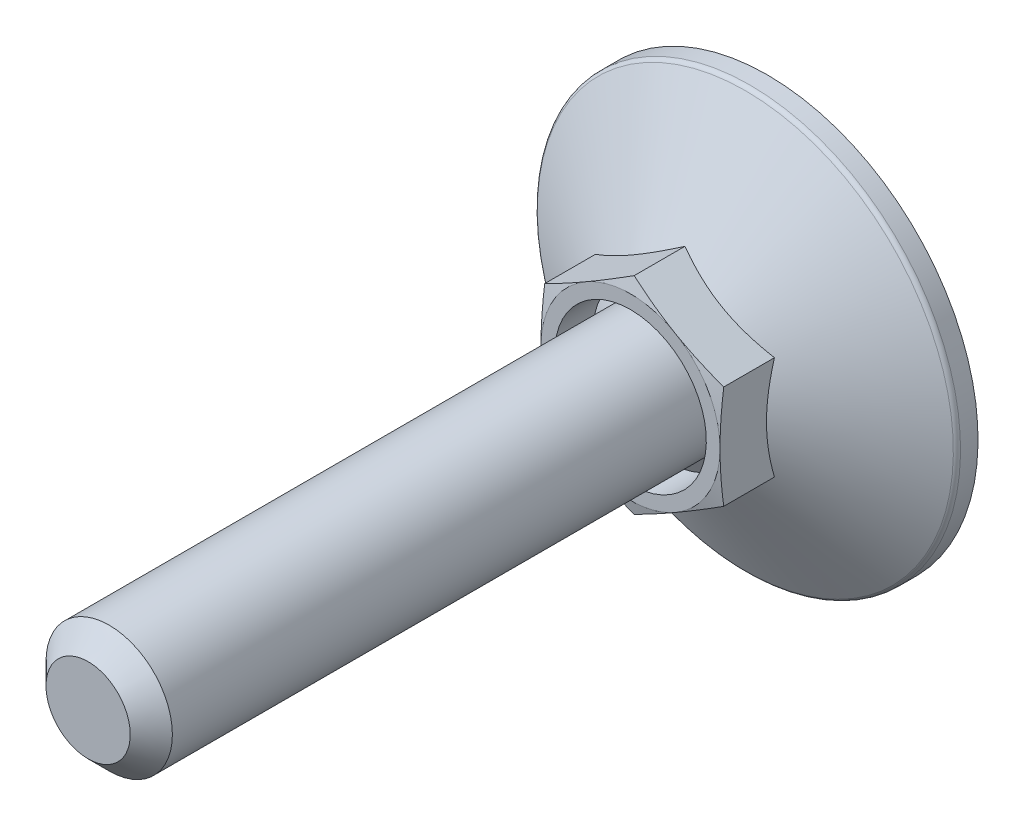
ISO-10303-21;
HEADER;
FILE_DESCRIPTION(('STEP AP214'),'2;1');
FILE_NAME('part.step','',(''),(''),'','','');
FILE_SCHEMA(('AUTOMOTIVE_DESIGN { 1 0 10303 214 1 1 1 1 }'));
ENDSEC;
DATA;
#1=APPLICATION_CONTEXT('core data for automotive mechanical design processes');
#2=APPLICATION_PROTOCOL_DEFINITION('international standard','automotive_design',2000,#1);
#3=PRODUCT_CONTEXT('',#1,'mechanical');
#4=PRODUCT('Part','Part','',(#3));
#5=PRODUCT_RELATED_PRODUCT_CATEGORY('part','',(#4));
#6=PRODUCT_DEFINITION_FORMATION('','',#4);
#7=PRODUCT_DEFINITION_CONTEXT('part definition',#1,'design');
#8=PRODUCT_DEFINITION('design','',#6,#7);
#9=PRODUCT_DEFINITION_SHAPE('','',#8);
#10=(LENGTH_UNIT() NAMED_UNIT(*) SI_UNIT(.MILLI.,.METRE.));
#11=(NAMED_UNIT(*) PLANE_ANGLE_UNIT() SI_UNIT($,.RADIAN.));
#12=(NAMED_UNIT(*) SI_UNIT($,.STERADIAN.) SOLID_ANGLE_UNIT());
#13=UNCERTAINTY_MEASURE_WITH_UNIT(LENGTH_MEASURE(1.E-05),#10,'distance_accuracy_value','');
#14=(GEOMETRIC_REPRESENTATION_CONTEXT(3) GLOBAL_UNCERTAINTY_ASSIGNED_CONTEXT((#13)) GLOBAL_UNIT_ASSIGNED_CONTEXT((#10,
#11,#12)) REPRESENTATION_CONTEXT('',''));
#15=CARTESIAN_POINT('',(0.,0.,0.));
#16=DIRECTION('',(0.,0.,1.));
#17=DIRECTION('',(1.,0.,0.));
#18=AXIS2_PLACEMENT_3D('',#15,#16,#17);
#19=CARTESIAN_POINT('',(0.,0.,0.));
#20=DIRECTION('',(0.,0.,-1.));
#21=DIRECTION('',(0.,1.,0.));
#22=AXIS2_PLACEMENT_3D('',#19,#20,#21);
#23=CYLINDRICAL_SURFACE('',#22,6.);
#24=CARTESIAN_POINT('',(0.,0.,62.5));
#25=DIRECTION('',(0.,0.,1.));
#26=DIRECTION('',(0.,-1.,0.));
#27=AXIS2_PLACEMENT_3D('',#24,#25,#26);
#28=CIRCLE('',#27,6.);
#29=CARTESIAN_POINT('',(0.,-6.,62.5));
#30=VERTEX_POINT('',#29);
#31=EDGE_CURVE('E9',#30,#30,#28,.F.);
#32=ORIENTED_EDGE('',*,*,#31,.T.);
#33=EDGE_LOOP('',(#32));
#34=FACE_BOUND('',#33,.T.);
#35=CARTESIAN_POINT('',(0.,0.,10.0329037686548));
#36=DIRECTION('',(0.,0.,-1.));
#37=DIRECTION('',(0.,1.,0.));
#38=AXIS2_PLACEMENT_3D('',#35,#36,#37);
#39=CIRCLE('',#38,6.);
#40=CARTESIAN_POINT('',(0.,6.,10.0329037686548));
#41=VERTEX_POINT('',#40);
#42=EDGE_CURVE('E180',#41,#41,#39,.F.);
#43=ORIENTED_EDGE('',*,*,#42,.T.);
#44=EDGE_LOOP('',(#43));
#45=FACE_BOUND('',#44,.T.);
#46=ADVANCED_FACE('F14',(#34,#45),#23,.T.);
#47=CARTESIAN_POINT('',(10.2,0.,0.));
#48=DIRECTION('',(0.,0.,1.));
#49=DIRECTION('',(0.,-1.,0.));
#50=AXIS2_PLACEMENT_3D('',#47,#48,#49);
#51=PLANE('',#50);
#52=DIRECTION('',(1.,0.,0.));
#53=VECTOR('',#52,1.);
#54=CARTESIAN_POINT('',(1.,-1.,0.));
#55=LINE('',#54,#53);
#56=CARTESIAN_POINT('',(1.,-1.,0.));
#57=VERTEX_POINT('',#56);
#58=CARTESIAN_POINT('',(6.66666666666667,-1.,0.));
#59=VERTEX_POINT('',#58);
#60=EDGE_CURVE('E706',#57,#59,#55,.T.);
#61=ORIENTED_EDGE('',*,*,#60,.T.);
#62=DIRECTION('',(0.,-1.,0.));
#63=VECTOR('',#62,1.);
#64=CARTESIAN_POINT('',(6.66666666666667,0.,0.));
#65=LINE('',#64,#63);
#66=CARTESIAN_POINT('',(6.66666666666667,1.,0.));
#67=VERTEX_POINT('',#66);
#68=EDGE_CURVE('E379',#67,#59,#65,.T.);
#69=ORIENTED_EDGE('',*,*,#68,.F.);
#70=DIRECTION('',(-1.,0.,0.));
#71=VECTOR('',#70,1.);
#72=CARTESIAN_POINT('',(6.66666666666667,1.,0.));
#73=LINE('',#72,#71);
#74=CARTESIAN_POINT('',(1.,1.,0.));
#75=VERTEX_POINT('',#74);
#76=EDGE_CURVE('E665',#67,#75,#73,.T.);
#77=ORIENTED_EDGE('',*,*,#76,.T.);
#78=DIRECTION('',(0.,1.,0.));
#79=VECTOR('',#78,1.);
#80=CARTESIAN_POINT('',(1.,1.,0.));
#81=LINE('',#80,#79);
#82=CARTESIAN_POINT('',(1.,6.66666666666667,0.));
#83=VERTEX_POINT('',#82);
#84=EDGE_CURVE('E662',#75,#83,#81,.T.);
#85=ORIENTED_EDGE('',*,*,#84,.T.);
#86=DIRECTION('',(-1.,0.,0.));
#87=VECTOR('',#86,1.);
#88=CARTESIAN_POINT('',(1.,6.66666666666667,0.));
#89=LINE('',#88,#87);
#90=CARTESIAN_POINT('',(-1.,6.66666666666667,0.));
#91=VERTEX_POINT('',#90);
#92=EDGE_CURVE('E655',#83,#91,#89,.T.);
#93=ORIENTED_EDGE('',*,*,#92,.T.);
#94=DIRECTION('',(0.,-1.,0.));
#95=VECTOR('',#94,1.);
#96=CARTESIAN_POINT('',(-1.,6.66666666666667,0.));
#97=LINE('',#96,#95);
#98=CARTESIAN_POINT('',(-1.,1.,0.));
#99=VERTEX_POINT('',#98);
#100=EDGE_CURVE('E175',#91,#99,#97,.T.);
#101=ORIENTED_EDGE('',*,*,#100,.T.);
#102=DIRECTION('',(-1.,0.,0.));
#103=VECTOR('',#102,1.);
#104=CARTESIAN_POINT('',(-1.,1.,0.));
#105=LINE('',#104,#103);
#106=CARTESIAN_POINT('',(-6.66666666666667,1.,0.));
#107=VERTEX_POINT('',#106);
#108=EDGE_CURVE('E29',#99,#107,#105,.T.);
#109=ORIENTED_EDGE('',*,*,#108,.T.);
#110=DIRECTION('',(0.,-1.,0.));
#111=VECTOR('',#110,1.);
#112=CARTESIAN_POINT('',(-6.66666666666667,1.,0.));
#113=LINE('',#112,#111);
#114=CARTESIAN_POINT('',(-6.66666666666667,-1.,0.));
#115=VERTEX_POINT('',#114);
#116=EDGE_CURVE('E179',#107,#115,#113,.T.);
#117=ORIENTED_EDGE('',*,*,#116,.T.);
#118=DIRECTION('',(1.,0.,0.));
#119=VECTOR('',#118,1.);
#120=CARTESIAN_POINT('',(-6.66666666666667,-1.,0.));
#121=LINE('',#120,#119);
#122=CARTESIAN_POINT('',(-1.,-1.,0.));
#123=VERTEX_POINT('',#122);
#124=EDGE_CURVE('E690',#115,#123,#121,.T.);
#125=ORIENTED_EDGE('',*,*,#124,.T.);
#126=DIRECTION('',(0.,-1.,0.));
#127=VECTOR('',#126,1.);
#128=CARTESIAN_POINT('',(-1.,-1.,0.));
#129=LINE('',#128,#127);
#130=CARTESIAN_POINT('',(-1.,-6.66666666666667,0.));
#131=VERTEX_POINT('',#130);
#132=EDGE_CURVE('E692',#123,#131,#129,.T.);
#133=ORIENTED_EDGE('',*,*,#132,.T.);
#134=DIRECTION('',(1.,0.,0.));
#135=VECTOR('',#134,1.);
#136=CARTESIAN_POINT('',(-1.,-6.66666666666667,0.));
#137=LINE('',#136,#135);
#138=CARTESIAN_POINT('',(1.,-6.66666666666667,0.));
#139=VERTEX_POINT('',#138);
#140=EDGE_CURVE('E696',#131,#139,#137,.T.);
#141=ORIENTED_EDGE('',*,*,#140,.T.);
#142=DIRECTION('',(0.,1.,0.));
#143=VECTOR('',#142,1.);
#144=CARTESIAN_POINT('',(1.,-6.66666666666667,0.));
#145=LINE('',#144,#143);
#146=EDGE_CURVE('E703',#139,#57,#145,.T.);
#147=ORIENTED_EDGE('',*,*,#146,.T.);
#148=EDGE_LOOP('',(#61,#69,#77,#85,#93,#101,#109,#117,#125,#133,#141,#147));
#149=FACE_BOUND('',#148,.T.);
#150=CARTESIAN_POINT('',(0.,0.,0.));
#151=DIRECTION('',(0.,0.,-1.));
#152=DIRECTION('',(0.,1.,0.));
#153=AXIS2_PLACEMENT_3D('',#150,#151,#152);
#154=CIRCLE('',#153,20.);
#155=CARTESIAN_POINT('',(0.,20.,0.));
#156=VERTEX_POINT('',#155);
#157=EDGE_CURVE('E184',#156,#156,#154,.T.);
#158=ORIENTED_EDGE('',*,*,#157,.T.);
#159=EDGE_LOOP('',(#158));
#160=FACE_BOUND('',#159,.T.);
#161=ADVANCED_FACE('F223',(#149,#160),#51,.F.);
#162=CARTESIAN_POINT('',(0.,0.,13.4970053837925));
#163=DIRECTION('',(0.,0.,-1.));
#164=DIRECTION('',(0.,1.,0.));
#165=AXIS2_PLACEMENT_3D('',#162,#163,#164);
#166=CONICAL_SURFACE('',#165,0.,1.0471975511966);
#167=CARTESIAN_POINT('',(0.,0.,9.34008344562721));
#168=DIRECTION('',(0.,0.,-1.));
#169=DIRECTION('',(0.,1.,0.));
#170=AXIS2_PLACEMENT_3D('',#167,#168,#169);
#171=CIRCLE('',#170,7.2);
#172=CARTESIAN_POINT('',(0.,7.2,9.34008344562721));
#173=VERTEX_POINT('',#172);
#174=EDGE_CURVE('E423',#173,#173,#171,.F.);
#175=ORIENTED_EDGE('',*,*,#174,.T.);
#176=EDGE_LOOP('',(#175));
#177=FACE_BOUND('',#176,.T.);
#178=ORIENTED_EDGE('',*,*,#42,.F.);
#179=EDGE_LOOP('',(#178));
#180=FACE_BOUND('',#179,.T.);
#181=ADVANCED_FACE('F217',(#177,#180),#166,.T.);
#182=CARTESIAN_POINT('',(0.,0.,0.));
#183=DIRECTION('',(0.,0.,-1.));
#184=DIRECTION('',(0.,1.,0.));
#185=AXIS2_PLACEMENT_3D('',#182,#183,#184);
#186=CYLINDRICAL_SURFACE('',#185,7.2);
#187=CARTESIAN_POINT('',(0.,0.,13.));
#188=DIRECTION('',(0.,0.,-1.));
#189=DIRECTION('',(0.,1.,0.));
#190=AXIS2_PLACEMENT_3D('',#187,#188,#189);
#191=CIRCLE('',#190,7.2);
#192=CARTESIAN_POINT('',(0.,7.2,13.));
#193=VERTEX_POINT('',#192);
#194=EDGE_CURVE('E380',#193,#193,#191,.T.);
#195=ORIENTED_EDGE('',*,*,#194,.F.);
#196=EDGE_LOOP('',(#195));
#197=FACE_BOUND('',#196,.T.);
#198=ORIENTED_EDGE('',*,*,#174,.F.);
#199=EDGE_LOOP('',(#198));
#200=FACE_BOUND('',#199,.T.);
#201=ADVANCED_FACE('F222',(#197,#200),#186,.F.);
#202=CARTESIAN_POINT('',(0.,9.81495457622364,199.));
#203=DIRECTION('',(0.5,-0.866025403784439,0.));
#204=DIRECTION('',(0.866025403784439,0.5,0.));
#205=AXIS2_PLACEMENT_3D('',#202,#203,#204);
#206=PLANE('',#205);
#207=CARTESIAN_POINT('',(-8.5002,4.90736181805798,7.83027204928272));
#208=CARTESIAN_POINT('',(-8.31336077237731,5.01523349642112,7.89254195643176));
#209=CARTESIAN_POINT('',(-8.1258249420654,5.1235073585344,7.95198579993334));
#210=CARTESIAN_POINT('',(-7.74923024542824,5.34093440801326,8.06444298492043));
#211=CARTESIAN_POINT('',(-7.56017075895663,5.45008795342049,8.1174535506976));
#212=CARTESIAN_POINT('',(-6.9899652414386,5.77929626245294,8.26579470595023));
#213=CARTESIAN_POINT('',(-6.60656835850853,6.00065055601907,8.3501691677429));
#214=CARTESIAN_POINT('',(-6.03282233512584,6.33190297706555,8.44910807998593));
#215=CARTESIAN_POINT('',(-5.84418723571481,6.44081150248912,8.47729289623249));
#216=CARTESIAN_POINT('',(-5.46606397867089,6.65912106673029,8.52455401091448));
#217=CARTESIAN_POINT('',(-5.27657589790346,6.76852206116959,8.54363111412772));
#218=CARTESIAN_POINT('',(-4.8972734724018,6.98751241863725,8.57219332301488));
#219=CARTESIAN_POINT('',(-4.7074597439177,7.09710142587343,8.58168931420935));
#220=CARTESIAN_POINT('',(-4.32765694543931,7.3163806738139,8.59088571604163));
#221=CARTESIAN_POINT('',(-4.13766788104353,7.42607091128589,8.59058642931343));
#222=CARTESIAN_POINT('',(-3.78247698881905,7.63114046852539,8.58087362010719));
#223=CARTESIAN_POINT('',(-3.6172500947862,7.72653426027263,8.57264492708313));
#224=CARTESIAN_POINT('',(-3.28718328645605,7.9170984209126,8.54893885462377));
#225=CARTESIAN_POINT('',(-3.12234339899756,8.01226877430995,8.53346098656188));
#226=CARTESIAN_POINT('',(-2.62846189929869,8.29741139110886,8.47651947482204));
#227=CARTESIAN_POINT('',(-2.30029449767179,8.48687892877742,8.42455503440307));
#228=CARTESIAN_POINT('',(-1.64047857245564,8.86782383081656,8.29464315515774));
#229=CARTESIAN_POINT('',(-1.30891425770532,9.05925257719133,8.21614502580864));
#230=CARTESIAN_POINT('',(-0.650730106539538,9.43925537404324,8.03798675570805));
#231=CARTESIAN_POINT('',(-0.324101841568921,9.62783429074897,7.93836845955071));
#232=CARTESIAN_POINT('',(0.000199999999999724,9.81507004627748,7.83027204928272));
#233=B_SPLINE_CURVE_WITH_KNOTS('',3,(#207,#208,#209,#210,#211,#212,#213,#214,#215,#216,#217,
#218,#219,#220,#221,#222,#223,#224,#225,#226,#227,#228,#229,#230,#231,#232),.UNSPECIFIED.,.F.,
.F.,(4,2,2,2,2,2,2,2,2,2,2,2,4),(0.,0.673596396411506,1.34748239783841,2.69805431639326,
3.356799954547,4.01548737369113,4.67342558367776,5.33134346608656,5.90409556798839,
6.47688628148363,7.62328361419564,8.79510569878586,9.9646274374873),.UNSPECIFIED.);
#234=CARTESIAN_POINT('',(-8.5,4.90747728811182,7.83033871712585));
#235=VERTEX_POINT('',#234);
#236=CARTESIAN_POINT('',(0.,9.81495457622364,7.83033871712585));
#237=VERTEX_POINT('',#236);
#238=EDGE_CURVE('E256',#235,#237,#233,.T.);
#239=ORIENTED_EDGE('',*,*,#238,.F.);
#240=DIRECTION('',(0.,0.,-1.));
#241=VECTOR('',#240,1.);
#242=CARTESIAN_POINT('',(-8.5,4.90747728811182,199.));
#243=LINE('',#242,#241);
#244=CARTESIAN_POINT('',(-8.5,4.90747728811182,12.6476589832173));
#245=VERTEX_POINT('',#244);
#246=EDGE_CURVE('E431',#245,#235,#243,.T.);
#247=ORIENTED_EDGE('',*,*,#246,.F.);
#248=CARTESIAN_POINT('',(0.000200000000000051,9.81507004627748,12.6476280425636));
#249=CARTESIAN_POINT('',(-0.352800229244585,9.61126526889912,12.7022599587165));
#250=CARTESIAN_POINT('',(-0.706440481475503,9.40709097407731,12.7518566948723));
#251=CARTESIAN_POINT('',(-1.41496987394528,8.99802133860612,12.8389934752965));
#252=CARTESIAN_POINT('',(-1.76985946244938,8.79312573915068,12.8765286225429));
#253=CARTESIAN_POINT('',(-2.47873586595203,8.38385575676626,12.9373509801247));
#254=CARTESIAN_POINT('',(-2.83271788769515,8.17948414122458,12.9607107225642));
#255=CARTESIAN_POINT('',(-3.5411333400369,7.77048028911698,12.9920337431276));
#256=CARTESIAN_POINT('',(-3.89556667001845,7.56584811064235,13.));
#257=CARTESIAN_POINT('',(-4.60443332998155,7.15658375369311,13.));
#258=CARTESIAN_POINT('',(-4.9588666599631,6.95195157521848,12.9920337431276));
#259=CARTESIAN_POINT('',(-5.66728211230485,6.54294772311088,12.9607107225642));
#260=CARTESIAN_POINT('',(-6.02126413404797,6.33857610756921,12.9373509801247));
#261=CARTESIAN_POINT('',(-6.73014053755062,5.92930612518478,12.8765286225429));
#262=CARTESIAN_POINT('',(-7.08503012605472,5.72441052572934,12.8389934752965));
#263=CARTESIAN_POINT('',(-7.7935595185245,5.31534089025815,12.7518566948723));
#264=CARTESIAN_POINT('',(-8.14719977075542,5.11116659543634,12.7022599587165));
#265=CARTESIAN_POINT('',(-8.5002,4.90736181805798,12.6476280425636));
#266=B_SPLINE_CURVE_WITH_KNOTS('',3,(#248,#249,#250,#251,#252,#253,#254,#255,#256,#257,#258,
#259,#260,#261,#262,#263,#264,#265),.UNSPECIFIED.,.F.,.F.,(4,2,2,2,2,2,2,2,4),(0.,
1.23382789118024,2.46815608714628,3.69611406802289,4.92383440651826,6.15155474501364,
7.37951272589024,8.61384092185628,9.84766881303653),.UNSPECIFIED.);
#267=CARTESIAN_POINT('',(-4.25,7.36121593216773,13.));
#268=VERTEX_POINT('',#267);
#269=EDGE_CURVE('E286',#268,#245,#266,.T.);
#270=ORIENTED_EDGE('',*,*,#269,.F.);
#271=CARTESIAN_POINT('',(0.,9.81495457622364,12.6476589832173));
#272=VERTEX_POINT('',#271);
#273=EDGE_CURVE('E395',#272,#268,#266,.T.);
#274=ORIENTED_EDGE('',*,*,#273,.F.);
#275=DIRECTION('',(0.,0.,-1.));
#276=VECTOR('',#275,1.);
#277=CARTESIAN_POINT('',(0.,9.81495457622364,199.));
#278=LINE('',#277,#276);
#279=EDGE_CURVE('E415',#272,#237,#278,.T.);
#280=ORIENTED_EDGE('',*,*,#279,.T.);
#281=EDGE_LOOP('',(#239,#247,#270,#274,#280));
#282=FACE_BOUND('',#281,.T.);
#283=ADVANCED_FACE('F228',(#282),#206,.F.);
#284=CARTESIAN_POINT('',(8.5,4.90747728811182,199.));
#285=DIRECTION('',(-0.5,-0.866025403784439,0.));
#286=DIRECTION('',(0.866025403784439,-0.5,0.));
#287=AXIS2_PLACEMENT_3D('',#284,#285,#286);
#288=PLANE('',#287);
#289=CARTESIAN_POINT('',(-0.0002,9.81507004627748,7.83027204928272));
#290=CARTESIAN_POINT('',(0.186639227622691,9.70719836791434,7.89254195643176));
#291=CARTESIAN_POINT('',(0.374175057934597,9.59892450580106,7.95198579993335));
#292=CARTESIAN_POINT('',(0.750769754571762,9.3814974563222,8.06444298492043));
#293=CARTESIAN_POINT('',(0.939829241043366,9.27234391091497,8.1174535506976));
#294=CARTESIAN_POINT('',(1.5100347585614,8.94313560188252,8.26579470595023));
#295=CARTESIAN_POINT('',(1.89343164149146,8.72178130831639,8.3501691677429));
#296=CARTESIAN_POINT('',(2.46717766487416,8.39052888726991,8.44910807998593));
#297=CARTESIAN_POINT('',(2.65581276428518,8.28162036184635,8.47729289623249));
#298=CARTESIAN_POINT('',(3.03393602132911,8.06331079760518,8.52455401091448));
#299=CARTESIAN_POINT('',(3.22342410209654,7.95390980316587,8.54363111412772));
#300=CARTESIAN_POINT('',(3.6027265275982,7.73491944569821,8.57219332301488));
#301=CARTESIAN_POINT('',(3.79254025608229,7.62533043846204,8.58168931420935));
#302=CARTESIAN_POINT('',(4.17234305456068,7.40605119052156,8.59088571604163));
#303=CARTESIAN_POINT('',(4.36233211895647,7.29636095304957,8.59058642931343));
#304=CARTESIAN_POINT('',(4.71752301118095,7.09129139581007,8.58087362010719));
#305=CARTESIAN_POINT('',(4.8827499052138,6.99589760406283,8.57264492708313));
#306=CARTESIAN_POINT('',(5.21281671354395,6.80533344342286,8.54893885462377));
#307=CARTESIAN_POINT('',(5.37765660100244,6.71016309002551,8.53346098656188));
#308=CARTESIAN_POINT('',(5.87153810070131,6.42502047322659,8.47651947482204));
#309=CARTESIAN_POINT('',(6.19970550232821,6.23555293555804,8.42455503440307));
#310=CARTESIAN_POINT('',(6.85952142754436,5.8546080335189,8.29464315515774));
#311=CARTESIAN_POINT('',(7.19108574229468,5.66317928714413,8.21614502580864));
#312=CARTESIAN_POINT('',(7.84926989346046,5.28317649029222,8.03798675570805));
#313=CARTESIAN_POINT('',(8.17589815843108,5.09459757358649,7.93836845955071));
#314=CARTESIAN_POINT('',(8.5002,4.90736181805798,7.83027204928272));
#315=B_SPLINE_CURVE_WITH_KNOTS('',3,(#289,#290,#291,#292,#293,#294,#295,#296,#297,#298,#299,
#300,#301,#302,#303,#304,#305,#306,#307,#308,#309,#310,#311,#312,#313,#314),.UNSPECIFIED.,.F.,
.F.,(4,2,2,2,2,2,2,2,2,2,2,2,4),(0.,0.673596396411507,1.34748239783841,2.69805431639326,
3.35679995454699,4.01548737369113,4.67342558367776,5.33134346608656,5.90409556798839,
6.47688628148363,7.62328361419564,8.79510569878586,9.9646274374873),.UNSPECIFIED.);
#316=CARTESIAN_POINT('',(8.5,4.90747728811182,7.83033871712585));
#317=VERTEX_POINT('',#316);
#318=EDGE_CURVE('E37',#237,#317,#315,.T.);
#319=ORIENTED_EDGE('',*,*,#318,.F.);
#320=ORIENTED_EDGE('',*,*,#279,.F.);
#321=CARTESIAN_POINT('',(8.5002,4.90736181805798,12.6476280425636));
#322=CARTESIAN_POINT('',(8.14719977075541,5.11116659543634,12.7022599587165));
#323=CARTESIAN_POINT('',(7.7935595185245,5.31534089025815,12.7518566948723));
#324=CARTESIAN_POINT('',(7.08503012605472,5.72441052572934,12.8389934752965));
#325=CARTESIAN_POINT('',(6.73014053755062,5.92930612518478,12.8765286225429));
#326=CARTESIAN_POINT('',(6.02126413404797,6.33857610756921,12.9373509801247));
#327=CARTESIAN_POINT('',(5.66728211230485,6.54294772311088,12.9607107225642));
#328=CARTESIAN_POINT('',(4.9588666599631,6.95195157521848,12.9920337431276));
#329=CARTESIAN_POINT('',(4.60443332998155,7.15658375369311,13.));
#330=CARTESIAN_POINT('',(3.89556667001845,7.56584811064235,13.));
#331=CARTESIAN_POINT('',(3.5411333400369,7.77048028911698,12.9920337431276));
#332=CARTESIAN_POINT('',(2.83271788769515,8.17948414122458,12.9607107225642));
#333=CARTESIAN_POINT('',(2.47873586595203,8.38385575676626,12.9373509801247));
#334=CARTESIAN_POINT('',(1.76985946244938,8.79312573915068,12.8765286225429));
#335=CARTESIAN_POINT('',(1.41496987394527,8.99802133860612,12.8389934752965));
#336=CARTESIAN_POINT('',(0.7064404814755,9.40709097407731,12.7518566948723));
#337=CARTESIAN_POINT('',(0.352800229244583,9.61126526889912,12.7022599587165));
#338=CARTESIAN_POINT('',(-0.000200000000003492,9.81507004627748,12.6476280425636));
#339=B_SPLINE_CURVE_WITH_KNOTS('',3,(#321,#322,#323,#324,#325,#326,#327,#328,#329,#330,#331,
#332,#333,#334,#335,#336,#337,#338),.UNSPECIFIED.,.F.,.F.,(4,2,2,2,2,2,2,2,4),(0.,
1.23382789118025,2.46815608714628,3.69611406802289,4.92383440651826,6.15155474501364,
7.37951272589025,8.61384092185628,9.84766881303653),.UNSPECIFIED.);
#340=CARTESIAN_POINT('',(4.25,7.36121593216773,13.));
#341=VERTEX_POINT('',#340);
#342=EDGE_CURVE('E269',#341,#272,#339,.T.);
#343=ORIENTED_EDGE('',*,*,#342,.F.);
#344=CARTESIAN_POINT('',(8.5,4.90747728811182,12.6476589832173));
#345=VERTEX_POINT('',#344);
#346=EDGE_CURVE('E278',#345,#341,#339,.T.);
#347=ORIENTED_EDGE('',*,*,#346,.F.);
#348=DIRECTION('',(0.,0.,-1.));
#349=VECTOR('',#348,1.);
#350=CARTESIAN_POINT('',(8.5,4.90747728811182,199.));
#351=LINE('',#350,#349);
#352=EDGE_CURVE('E417',#345,#317,#351,.T.);
#353=ORIENTED_EDGE('',*,*,#352,.T.);
#354=EDGE_LOOP('',(#319,#320,#343,#347,#353));
#355=FACE_BOUND('',#354,.T.);
#356=ADVANCED_FACE('F262',(#355),#288,.F.);
#357=CARTESIAN_POINT('',(8.5,-4.90747728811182,199.));
#358=DIRECTION('',(-1.,0.,0.));
#359=DIRECTION('',(0.,-1.,0.));
#360=AXIS2_PLACEMENT_3D('',#357,#358,#359);
#361=PLANE('',#360);
#362=CARTESIAN_POINT('',(8.5,12.8220542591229,4.61528116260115));
#363=CARTESIAN_POINT('',(8.5,12.4534155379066,4.79262377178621));
#364=CARTESIAN_POINT('',(8.5,12.0838902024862,4.96815716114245));
#365=CARTESIAN_POINT('',(8.5,11.3425927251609,5.31457894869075));
#366=CARTESIAN_POINT('',(8.5,10.9708202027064,5.48546653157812));
#367=CARTESIAN_POINT('',(8.5,10.2224625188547,5.82250763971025));
#368=CARTESIAN_POINT('',(8.5,9.84586188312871,5.98862693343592));
#369=CARTESIAN_POINT('',(8.5,9.08953299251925,6.31355867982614));
#370=CARTESIAN_POINT('',(8.5,8.70980489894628,6.47237150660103));
#371=CARTESIAN_POINT('',(8.5,7.93635853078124,6.78489169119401));
#372=CARTESIAN_POINT('',(8.5,7.5425381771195,6.93834789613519));
#373=CARTESIAN_POINT('',(8.5,6.75016193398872,7.23275009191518));
#374=CARTESIAN_POINT('',(8.5,6.35160550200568,7.37369463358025));
#375=CARTESIAN_POINT('',(8.5,5.54998630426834,7.63911020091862));
#376=CARTESIAN_POINT('',(8.5,5.14693580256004,7.76361784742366));
#377=CARTESIAN_POINT('',(8.5,4.33508769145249,7.99193558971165));
#378=CARTESIAN_POINT('',(8.5,3.92629204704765,8.09575258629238));
#379=CARTESIAN_POINT('',(8.5,3.10458766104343,8.27700176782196));
#380=CARTESIAN_POINT('',(8.5,2.69170444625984,8.35454642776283));
#381=CARTESIAN_POINT('',(8.5,2.06892742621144,8.44757828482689));
#382=CARTESIAN_POINT('',(8.5,1.86074253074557,8.47470931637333));
#383=CARTESIAN_POINT('',(8.5,1.44346514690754,8.52067173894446));
#384=CARTESIAN_POINT('',(8.5,1.23437274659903,8.5395039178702));
#385=CARTESIAN_POINT('',(8.5,0.818123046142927,8.5682751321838));
#386=CARTESIAN_POINT('',(8.5,0.6109730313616,8.57831925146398));
#387=CARTESIAN_POINT('',(8.5,0.196434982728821,8.58967320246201));
#388=CARTESIAN_POINT('',(8.5,-0.0109530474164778,8.59098316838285));
#389=CARTESIAN_POINT('',(8.5,-0.425608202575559,8.58483724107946));
#390=CARTESIAN_POINT('',(8.5,-0.632875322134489,8.57738097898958));
#391=CARTESIAN_POINT('',(8.5,-1.04692490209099,8.55387613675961));
#392=CARTESIAN_POINT('',(8.5,-1.25370733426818,8.5378270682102));
#393=CARTESIAN_POINT('',(8.5,-1.76172684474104,8.48816674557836));
#394=CARTESIAN_POINT('',(8.5,-2.06251418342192,8.44986872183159));
#395=CARTESIAN_POINT('',(8.5,-2.66160170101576,8.35726697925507));
#396=CARTESIAN_POINT('',(8.5,-2.95990148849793,8.30296078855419));
#397=CARTESIAN_POINT('',(8.5,-3.85084347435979,8.11893322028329));
#398=CARTESIAN_POINT('',(8.5,-4.4391769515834,7.96814146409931));
#399=CARTESIAN_POINT('',(8.5,-5.31919968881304,7.70971639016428));
#400=CARTESIAN_POINT('',(8.5,-5.61551051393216,7.61694416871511));
#401=CARTESIAN_POINT('',(8.5,-6.20524874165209,7.4225646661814));
#402=CARTESIAN_POINT('',(8.5,-6.4986761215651,7.3209573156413));
#403=CARTESIAN_POINT('',(8.5,-7.08276471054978,7.11046965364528));
#404=CARTESIAN_POINT('',(8.5,-7.37342689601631,7.0015920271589));
#405=CARTESIAN_POINT('',(8.5,-7.95239195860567,6.77777126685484));
#406=CARTESIAN_POINT('',(8.5,-8.2406948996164,6.66282829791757));
#407=CARTESIAN_POINT('',(8.5,-8.80562449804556,6.43181846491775));
#408=CARTESIAN_POINT('',(8.5,-9.08231928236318,6.31591764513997));
#409=CARTESIAN_POINT('',(8.5,-9.63401072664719,6.0801365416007));
#410=CARTESIAN_POINT('',(8.5,-9.90900735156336,5.96025617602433));
#411=CARTESIAN_POINT('',(8.5,-10.7318217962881,5.59557173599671));
#412=CARTESIAN_POINT('',(8.5,-11.2774137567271,5.34574521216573));
#413=CARTESIAN_POINT('',(8.5,-12.3642460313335,4.83628492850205));
#414=CARTESIAN_POINT('',(8.5,-12.905484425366,4.57664710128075));
#415=CARTESIAN_POINT('',(8.5,-13.9843891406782,4.05013469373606));
#416=CARTESIAN_POINT('',(8.5,-14.5220556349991,3.78326046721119));
#417=CARTESIAN_POINT('',(8.5,-15.5954930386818,3.24355438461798));
#418=CARTESIAN_POINT('',(8.5,-16.1312593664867,2.97071343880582));
#419=CARTESIAN_POINT('',(8.5,-17.2005865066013,2.4207361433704));
#420=CARTESIAN_POINT('',(8.5,-17.7341472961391,2.14359974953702));
#421=CARTESIAN_POINT('',(8.5,-18.7993643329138,1.58600707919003));
#422=CARTESIAN_POINT('',(8.5,-19.3310210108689,1.30555162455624));
#423=CARTESIAN_POINT('',(8.5,-20.3928917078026,0.741921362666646));
#424=CARTESIAN_POINT('',(8.5,-20.9231057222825,0.458746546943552));
#425=CARTESIAN_POINT('',(8.5,-22.3874236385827,-0.32722037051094));
#426=CARTESIAN_POINT('',(8.5,-23.3202800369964,-0.83233607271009));
#427=CARTESIAN_POINT('',(8.5,-25.1833983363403,-1.84747335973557));
#428=CARTESIAN_POINT('',(8.5,-26.1136600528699,-2.35749528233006));
#429=CARTESIAN_POINT('',(8.5,-27.9692131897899,-3.37950461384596));
#430=CARTESIAN_POINT('',(8.5,-28.8945109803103,-3.89148046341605));
#431=CARTESIAN_POINT('',(8.5,-30.2812847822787,-4.66146611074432));
#432=CARTESIAN_POINT('',(8.5,-30.7433285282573,-4.91845451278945));
#433=CARTESIAN_POINT('',(8.5,-31.6670795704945,-5.43303439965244));
#434=CARTESIAN_POINT('',(8.5,-32.1287868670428,-5.69062588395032));
#435=CARTESIAN_POINT('',(8.5,-32.5903473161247,-5.94848028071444));
#436=B_SPLINE_CURVE_WITH_KNOTS('',3,(#362,#363,#364,#365,#366,#367,#368,#369,#370,#371,#372,
#373,#374,#375,#376,#377,#378,#379,#380,#381,#382,#383,#384,#385,#386,#387,#388,#389,#390,#391,
#392,#393,#394,#395,#396,#397,#398,#399,#400,#401,#402,#403,#404,#405,#406,#407,#408,#409,#410,
#411,#412,#413,#414,#415,#416,#417,#418,#419,#420,#421,#422,#423,#424,#425,#426,#427,#428,#429,
#430,#431,#432,#433,#434,#435),.UNSPECIFIED.,.F.,.F.,(4,2,2,2,2,2,2,2,2,2,2,2,2,2,2,2,2,2,2,2,2,
2,2,2,2,2,2,2,2,2,2,2,2,2,2,2,4),(0.,1.22725127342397,2.45471654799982,3.68948778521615,
4.92419572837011,6.19201746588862,7.45998585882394,8.72507978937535,9.98975107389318,
11.2489376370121,11.878634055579,12.5082706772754,13.1302712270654,13.7522622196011,
14.3742793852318,14.9963319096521,15.9054589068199,16.814726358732,18.6343169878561,
19.5657329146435,20.4971561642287,21.4282373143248,22.3592931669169,23.259222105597,
24.1591695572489,25.9592281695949,27.7600413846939,29.5607667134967,31.3644583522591,
33.1681685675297,34.9714411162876,36.7747192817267,39.9571898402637,43.1398810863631,
46.3123590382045,47.8984694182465,49.4845784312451),.UNSPECIFIED.);
#437=CARTESIAN_POINT('',(8.5,-4.90747728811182,7.83033871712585));
#438=VERTEX_POINT('',#437);
#439=EDGE_CURVE('E245',#317,#438,#436,.T.);
#440=ORIENTED_EDGE('',*,*,#439,.F.);
#441=ORIENTED_EDGE('',*,*,#352,.F.);
#442=CARTESIAN_POINT('',(8.5,12.9820891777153,11.1197370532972));
#443=CARTESIAN_POINT('',(8.5,12.5964686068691,11.2061594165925));
#444=CARTESIAN_POINT('',(8.5,12.2106068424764,11.2915248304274));
#445=CARTESIAN_POINT('',(8.5,11.4382824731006,11.4595712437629));
#446=CARTESIAN_POINT('',(8.5,11.0518198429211,11.5422521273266));
#447=CARTESIAN_POINT('',(8.5,10.2778290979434,11.7044309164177));
#448=CARTESIAN_POINT('',(8.5,9.89030030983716,11.7839256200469));
#449=CARTESIAN_POINT('',(8.5,9.11443612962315,11.9388739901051));
#450=CARTESIAN_POINT('',(8.5,8.72610074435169,12.0143276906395));
#451=CARTESIAN_POINT('',(8.5,7.95158013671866,12.159650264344));
#452=CARTESIAN_POINT('',(8.5,7.56540239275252,12.2295587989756));
#453=CARTESIAN_POINT('',(8.5,6.79199352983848,12.3632725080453));
#454=CARTESIAN_POINT('',(8.5,6.40476243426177,12.4270778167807));
#455=CARTESIAN_POINT('',(8.5,5.62917169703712,12.54714843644));
#456=CARTESIAN_POINT('',(8.5,5.24081220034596,12.6034146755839));
#457=CARTESIAN_POINT('',(8.5,4.46285737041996,12.70674908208));
#458=CARTESIAN_POINT('',(8.5,4.07326203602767,12.7538172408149));
#459=CARTESIAN_POINT('',(8.5,3.28844017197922,12.8374226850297));
#460=CARTESIAN_POINT('',(8.5,2.89320002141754,12.8738340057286));
#461=CARTESIAN_POINT('',(8.5,2.10172608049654,12.9336139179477));
#462=CARTESIAN_POINT('',(8.5,1.70549231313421,12.9569828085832));
#463=CARTESIAN_POINT('',(8.5,0.912605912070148,12.9893148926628));
#464=CARTESIAN_POINT('',(8.5,0.515953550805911,12.9982846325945));
#465=CARTESIAN_POINT('',(8.5,-0.27740821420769,13.0012669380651));
#466=CARTESIAN_POINT('',(8.5,-0.674117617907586,12.9952795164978));
#467=CARTESIAN_POINT('',(8.5,-1.46847963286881,12.9686842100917));
#468=CARTESIAN_POINT('',(8.5,-1.86613043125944,12.9480232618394));
#469=CARTESIAN_POINT('',(8.5,-2.66049684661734,12.8932602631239));
#470=CARTESIAN_POINT('',(8.5,-3.05721244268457,12.8591579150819));
#471=CARTESIAN_POINT('',(8.5,-3.84970511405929,12.7792347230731));
#472=CARTESIAN_POINT('',(8.5,-4.24548140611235,12.7334062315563));
#473=CARTESIAN_POINT('',(8.5,-5.03576028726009,12.6319377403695));
#474=CARTESIAN_POINT('',(8.5,-5.43026287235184,12.5762977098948));
#475=CARTESIAN_POINT('',(8.5,-6.19195385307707,12.4609360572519));
#476=CARTESIAN_POINT('',(8.5,-6.55922094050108,12.4017287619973));
#477=CARTESIAN_POINT('',(8.5,-7.29278719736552,12.2775674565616));
#478=CARTESIAN_POINT('',(8.5,-7.65908634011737,12.2126132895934));
#479=CARTESIAN_POINT('',(8.5,-8.39085027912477,12.078008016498));
#480=CARTESIAN_POINT('',(8.5,-8.75631499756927,12.0083564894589));
#481=CARTESIAN_POINT('',(8.5,-9.48649515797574,11.8652200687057));
#482=CARTESIAN_POINT('',(8.5,-9.85121059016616,11.7917351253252));
#483=CARTESIAN_POINT('',(8.5,-10.5800753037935,11.6416087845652));
#484=CARTESIAN_POINT('',(8.5,-10.944224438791,11.5649666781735));
#485=CARTESIAN_POINT('',(8.5,-11.6719684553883,11.4090909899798));
#486=CARTESIAN_POINT('',(8.5,-12.0355633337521,11.3298573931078));
#487=CARTESIAN_POINT('',(8.5,-13.1255915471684,11.0889686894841));
#488=CARTESIAN_POINT('',(8.5,-13.8513178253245,10.9241153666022));
#489=CARTESIAN_POINT('',(8.5,-15.2942598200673,10.590109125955));
#490=CARTESIAN_POINT('',(8.5,-16.0114890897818,10.421014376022));
#491=CARTESIAN_POINT('',(8.5,-17.4449475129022,10.0785875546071));
#492=CARTESIAN_POINT('',(8.5,-18.1611766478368,9.9052554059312));
#493=CARTESIAN_POINT('',(8.5,-19.5919856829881,9.55567998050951));
#494=CARTESIAN_POINT('',(8.5,-20.306566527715,9.37944056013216));
#495=CARTESIAN_POINT('',(8.5,-21.7351057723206,9.02455520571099));
#496=CARTESIAN_POINT('',(8.5,-22.4490641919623,8.84590935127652));
#497=CARTESIAN_POINT('',(8.5,-23.1628057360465,8.66641079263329));
#498=B_SPLINE_CURVE_WITH_KNOTS('',3,(#442,#443,#444,#445,#446,#447,#448,#449,#450,#451,#452,
#453,#454,#455,#456,#457,#458,#459,#460,#461,#462,#463,#464,#465,#466,#467,#468,#469,#470,#471,
#472,#473,#474,#475,#476,#477,#478,#479,#480,#481,#482,#483,#484,#485,#486,#487,#488,#489,#490,
#491,#492,#493,#494,#495,#496,#497),.UNSPECIFIED.,.F.,.F.,(4,2,2,2,2,2,2,2,2,2,2,2,2,2,2,2,2,2,
2,2,2,2,2,2,2,2,2,4),(0.,1.18556310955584,2.37117735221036,3.5579546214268,4.74472187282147,
5.92204594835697,7.09934411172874,8.27649719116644,9.45365137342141,10.6442044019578,
11.8347301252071,13.0247144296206,14.2146977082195,15.4090063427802,16.6033414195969,
17.7984574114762,18.9935771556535,20.1095500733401,21.2255534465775,22.3416569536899,
23.4577749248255,24.5741449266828,25.6905214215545,27.9231231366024,30.1337863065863,
32.3444897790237,34.5524651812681,36.7603677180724),.UNSPECIFIED.);
#499=CARTESIAN_POINT('',(8.5,0.,13.));
#500=VERTEX_POINT('',#499);
#501=EDGE_CURVE('E280',#500,#345,#498,.F.);
#502=ORIENTED_EDGE('',*,*,#501,.F.);
#503=CARTESIAN_POINT('',(8.5,-4.90747728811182,12.6476589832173));
#504=VERTEX_POINT('',#503);
#505=EDGE_CURVE('E279',#504,#500,#498,.F.);
#506=ORIENTED_EDGE('',*,*,#505,.F.);
#507=DIRECTION('',(0.,0.,-1.));
#508=VECTOR('',#507,1.);
#509=CARTESIAN_POINT('',(8.5,-4.90747728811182,199.));
#510=LINE('',#509,#508);
#511=EDGE_CURVE('E421',#504,#438,#510,.T.);
#512=ORIENTED_EDGE('',*,*,#511,.T.);
#513=EDGE_LOOP('',(#440,#441,#502,#506,#512));
#514=FACE_BOUND('',#513,.T.);
#515=ADVANCED_FACE('F265',(#514),#361,.F.);
#516=CARTESIAN_POINT('',(0.,-9.81495457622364,199.));
#517=DIRECTION('',(-0.5,0.866025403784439,0.));
#518=DIRECTION('',(-0.866025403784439,-0.5,0.));
#519=AXIS2_PLACEMENT_3D('',#516,#517,#518);
#520=PLANE('',#519);
#521=CARTESIAN_POINT('',(8.5002,-4.90736181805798,7.83027204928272));
#522=CARTESIAN_POINT('',(8.31336077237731,-5.01523349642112,7.89254195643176));
#523=CARTESIAN_POINT('',(8.1258249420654,-5.1235073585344,7.95198579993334));
#524=CARTESIAN_POINT('',(7.74923024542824,-5.34093440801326,8.06444298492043));
#525=CARTESIAN_POINT('',(7.56017075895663,-5.45008795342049,8.1174535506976));
#526=CARTESIAN_POINT('',(6.9899652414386,-5.77929626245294,8.26579470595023));
#527=CARTESIAN_POINT('',(6.60656835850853,-6.00065055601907,8.3501691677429));
#528=CARTESIAN_POINT('',(6.03282233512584,-6.33190297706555,8.44910807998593));
#529=CARTESIAN_POINT('',(5.84418723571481,-6.44081150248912,8.47729289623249));
#530=CARTESIAN_POINT('',(5.46606397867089,-6.65912106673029,8.52455401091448));
#531=CARTESIAN_POINT('',(5.27657589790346,-6.76852206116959,8.54363111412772));
#532=CARTESIAN_POINT('',(4.8972734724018,-6.98751241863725,8.57219332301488));
#533=CARTESIAN_POINT('',(4.7074597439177,-7.09710142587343,8.58168931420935));
#534=CARTESIAN_POINT('',(4.32765694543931,-7.3163806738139,8.59088571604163));
#535=CARTESIAN_POINT('',(4.13766788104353,-7.42607091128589,8.59058642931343));
#536=CARTESIAN_POINT('',(3.78247698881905,-7.63114046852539,8.58087362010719));
#537=CARTESIAN_POINT('',(3.6172500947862,-7.72653426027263,8.57264492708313));
#538=CARTESIAN_POINT('',(3.28718328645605,-7.9170984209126,8.54893885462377));
#539=CARTESIAN_POINT('',(3.12234339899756,-8.01226877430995,8.53346098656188));
#540=CARTESIAN_POINT('',(2.62846189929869,-8.29741139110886,8.47651947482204));
#541=CARTESIAN_POINT('',(2.30029449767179,-8.48687892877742,8.42455503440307));
#542=CARTESIAN_POINT('',(1.64047857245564,-8.86782383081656,8.29464315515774));
#543=CARTESIAN_POINT('',(1.30891425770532,-9.05925257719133,8.21614502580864));
#544=CARTESIAN_POINT('',(0.650730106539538,-9.43925537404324,8.03798675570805));
#545=CARTESIAN_POINT('',(0.324101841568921,-9.62783429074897,7.93836845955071));
#546=CARTESIAN_POINT('',(-0.000199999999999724,-9.81507004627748,7.83027204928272));
#547=B_SPLINE_CURVE_WITH_KNOTS('',3,(#521,#522,#523,#524,#525,#526,#527,#528,#529,#530,#531,
#532,#533,#534,#535,#536,#537,#538,#539,#540,#541,#542,#543,#544,#545,#546),.UNSPECIFIED.,.F.,
.F.,(4,2,2,2,2,2,2,2,2,2,2,2,4),(0.,0.673596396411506,1.34748239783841,2.69805431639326,
3.356799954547,4.01548737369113,4.67342558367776,5.33134346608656,5.90409556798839,
6.47688628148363,7.62328361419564,8.79510569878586,9.9646274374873),.UNSPECIFIED.);
#548=CARTESIAN_POINT('',(0.,-9.81495457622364,7.83033871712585));
#549=VERTEX_POINT('',#548);
#550=EDGE_CURVE('E207',#438,#549,#547,.T.);
#551=ORIENTED_EDGE('',*,*,#550,.F.);
#552=ORIENTED_EDGE('',*,*,#511,.F.);
#553=CARTESIAN_POINT('',(-0.000200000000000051,-9.81507004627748,12.6476280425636));
#554=CARTESIAN_POINT('',(0.352800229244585,-9.61126526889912,12.7022599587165));
#555=CARTESIAN_POINT('',(0.706440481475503,-9.40709097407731,12.7518566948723));
#556=CARTESIAN_POINT('',(1.41496987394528,-8.99802133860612,12.8389934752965));
#557=CARTESIAN_POINT('',(1.76985946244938,-8.79312573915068,12.8765286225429));
#558=CARTESIAN_POINT('',(2.47873586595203,-8.38385575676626,12.9373509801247));
#559=CARTESIAN_POINT('',(2.83271788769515,-8.17948414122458,12.9607107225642));
#560=CARTESIAN_POINT('',(3.5411333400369,-7.77048028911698,12.9920337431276));
#561=CARTESIAN_POINT('',(3.89556667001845,-7.56584811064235,13.));
#562=CARTESIAN_POINT('',(4.60443332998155,-7.15658375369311,13.));
#563=CARTESIAN_POINT('',(4.9588666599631,-6.95195157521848,12.9920337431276));
#564=CARTESIAN_POINT('',(5.66728211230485,-6.54294772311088,12.9607107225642));
#565=CARTESIAN_POINT('',(6.02126413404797,-6.33857610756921,12.9373509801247));
#566=CARTESIAN_POINT('',(6.73014053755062,-5.92930612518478,12.8765286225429));
#567=CARTESIAN_POINT('',(7.08503012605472,-5.72441052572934,12.8389934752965));
#568=CARTESIAN_POINT('',(7.7935595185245,-5.31534089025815,12.7518566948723));
#569=CARTESIAN_POINT('',(8.14719977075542,-5.11116659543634,12.7022599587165));
#570=CARTESIAN_POINT('',(8.5002,-4.90736181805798,12.6476280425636));
#571=B_SPLINE_CURVE_WITH_KNOTS('',3,(#553,#554,#555,#556,#557,#558,#559,#560,#561,#562,#563,
#564,#565,#566,#567,#568,#569,#570),.UNSPECIFIED.,.F.,.F.,(4,2,2,2,2,2,2,2,4),(0.,
1.23382789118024,2.46815608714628,3.69611406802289,4.92383440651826,6.15155474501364,
7.37951272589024,8.61384092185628,9.84766881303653),.UNSPECIFIED.);
#572=CARTESIAN_POINT('',(4.25,-7.36121593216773,13.));
#573=VERTEX_POINT('',#572);
#574=EDGE_CURVE('E320',#573,#504,#571,.T.);
#575=ORIENTED_EDGE('',*,*,#574,.F.);
#576=CARTESIAN_POINT('',(0.,-9.81495457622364,12.6476589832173));
#577=VERTEX_POINT('',#576);
#578=EDGE_CURVE('E326',#577,#573,#571,.T.);
#579=ORIENTED_EDGE('',*,*,#578,.F.);
#580=DIRECTION('',(0.,0.,-1.));
#581=VECTOR('',#580,1.);
#582=CARTESIAN_POINT('',(0.,-9.81495457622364,199.));
#583=LINE('',#582,#581);
#584=EDGE_CURVE('E427',#577,#549,#583,.T.);
#585=ORIENTED_EDGE('',*,*,#584,.T.);
#586=EDGE_LOOP('',(#551,#552,#575,#579,#585));
#587=FACE_BOUND('',#586,.T.);
#588=ADVANCED_FACE('F328',(#587),#520,.F.);
#589=CARTESIAN_POINT('',(-8.5,-4.90747728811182,199.));
#590=DIRECTION('',(0.5,0.866025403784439,0.));
#591=DIRECTION('',(-0.866025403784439,0.5,0.));
#592=AXIS2_PLACEMENT_3D('',#589,#590,#591);
#593=PLANE('',#592);
#594=CARTESIAN_POINT('',(0.0002,-9.81507004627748,7.83027204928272));
#595=CARTESIAN_POINT('',(-0.186639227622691,-9.70719836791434,7.89254195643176));
#596=CARTESIAN_POINT('',(-0.374175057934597,-9.59892450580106,7.95198579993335));
#597=CARTESIAN_POINT('',(-0.750769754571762,-9.3814974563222,8.06444298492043));
#598=CARTESIAN_POINT('',(-0.939829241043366,-9.27234391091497,8.1174535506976));
#599=CARTESIAN_POINT('',(-1.5100347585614,-8.94313560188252,8.26579470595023));
#600=CARTESIAN_POINT('',(-1.89343164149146,-8.72178130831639,8.3501691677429));
#601=CARTESIAN_POINT('',(-2.46717766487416,-8.39052888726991,8.44910807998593));
#602=CARTESIAN_POINT('',(-2.65581276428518,-8.28162036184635,8.47729289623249));
#603=CARTESIAN_POINT('',(-3.03393602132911,-8.06331079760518,8.52455401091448));
#604=CARTESIAN_POINT('',(-3.22342410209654,-7.95390980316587,8.54363111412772));
#605=CARTESIAN_POINT('',(-3.6027265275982,-7.73491944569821,8.57219332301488));
#606=CARTESIAN_POINT('',(-3.79254025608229,-7.62533043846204,8.58168931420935));
#607=CARTESIAN_POINT('',(-4.17234305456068,-7.40605119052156,8.59088571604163));
#608=CARTESIAN_POINT('',(-4.36233211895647,-7.29636095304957,8.59058642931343));
#609=CARTESIAN_POINT('',(-4.71752301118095,-7.09129139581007,8.58087362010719));
#610=CARTESIAN_POINT('',(-4.8827499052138,-6.99589760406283,8.57264492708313));
#611=CARTESIAN_POINT('',(-5.21281671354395,-6.80533344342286,8.54893885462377));
#612=CARTESIAN_POINT('',(-5.37765660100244,-6.71016309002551,8.53346098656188));
#613=CARTESIAN_POINT('',(-5.87153810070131,-6.42502047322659,8.47651947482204));
#614=CARTESIAN_POINT('',(-6.19970550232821,-6.23555293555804,8.42455503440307));
#615=CARTESIAN_POINT('',(-6.85952142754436,-5.8546080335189,8.29464315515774));
#616=CARTESIAN_POINT('',(-7.19108574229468,-5.66317928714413,8.21614502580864));
#617=CARTESIAN_POINT('',(-7.84926989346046,-5.28317649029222,8.03798675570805));
#618=CARTESIAN_POINT('',(-8.17589815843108,-5.09459757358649,7.93836845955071));
#619=CARTESIAN_POINT('',(-8.5002,-4.90736181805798,7.83027204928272));
#620=B_SPLINE_CURVE_WITH_KNOTS('',3,(#594,#595,#596,#597,#598,#599,#600,#601,#602,#603,#604,
#605,#606,#607,#608,#609,#610,#611,#612,#613,#614,#615,#616,#617,#618,#619),.UNSPECIFIED.,.F.,
.F.,(4,2,2,2,2,2,2,2,2,2,2,2,4),(0.,0.673596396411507,1.34748239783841,2.69805431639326,
3.35679995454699,4.01548737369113,4.67342558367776,5.33134346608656,5.90409556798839,
6.47688628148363,7.62328361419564,8.79510569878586,9.9646274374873),.UNSPECIFIED.);
#621=CARTESIAN_POINT('',(-8.5,-4.90747728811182,7.83033871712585));
#622=VERTEX_POINT('',#621);
#623=EDGE_CURVE('E198',#549,#622,#620,.T.);
#624=ORIENTED_EDGE('',*,*,#623,.F.);
#625=ORIENTED_EDGE('',*,*,#584,.F.);
#626=CARTESIAN_POINT('',(-8.5002,-4.90736181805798,12.6476280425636));
#627=CARTESIAN_POINT('',(-8.14719977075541,-5.11116659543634,12.7022599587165));
#628=CARTESIAN_POINT('',(-7.7935595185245,-5.31534089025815,12.7518566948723));
#629=CARTESIAN_POINT('',(-7.08503012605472,-5.72441052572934,12.8389934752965));
#630=CARTESIAN_POINT('',(-6.73014053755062,-5.92930612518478,12.8765286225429));
#631=CARTESIAN_POINT('',(-6.02126413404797,-6.33857610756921,12.9373509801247));
#632=CARTESIAN_POINT('',(-5.66728211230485,-6.54294772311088,12.9607107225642));
#633=CARTESIAN_POINT('',(-4.9588666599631,-6.95195157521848,12.9920337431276));
#634=CARTESIAN_POINT('',(-4.60443332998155,-7.15658375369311,13.));
#635=CARTESIAN_POINT('',(-3.89556667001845,-7.56584811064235,13.));
#636=CARTESIAN_POINT('',(-3.5411333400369,-7.77048028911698,12.9920337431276));
#637=CARTESIAN_POINT('',(-2.83271788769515,-8.17948414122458,12.9607107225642));
#638=CARTESIAN_POINT('',(-2.47873586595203,-8.38385575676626,12.9373509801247));
#639=CARTESIAN_POINT('',(-1.76985946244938,-8.79312573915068,12.8765286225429));
#640=CARTESIAN_POINT('',(-1.41496987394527,-8.99802133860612,12.8389934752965));
#641=CARTESIAN_POINT('',(-0.7064404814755,-9.40709097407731,12.7518566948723));
#642=CARTESIAN_POINT('',(-0.352800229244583,-9.61126526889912,12.7022599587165));
#643=CARTESIAN_POINT('',(0.000200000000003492,-9.81507004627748,12.6476280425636));
#644=B_SPLINE_CURVE_WITH_KNOTS('',3,(#626,#627,#628,#629,#630,#631,#632,#633,#634,#635,#636,
#637,#638,#639,#640,#641,#642,#643),.UNSPECIFIED.,.F.,.F.,(4,2,2,2,2,2,2,2,4),(0.,
1.23382789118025,2.46815608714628,3.69611406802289,4.92383440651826,6.15155474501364,
7.37951272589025,8.61384092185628,9.84766881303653),.UNSPECIFIED.);
#645=CARTESIAN_POINT('',(-4.25,-7.36121593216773,13.));
#646=VERTEX_POINT('',#645);
#647=EDGE_CURVE('E314',#646,#577,#644,.T.);
#648=ORIENTED_EDGE('',*,*,#647,.F.);
#649=CARTESIAN_POINT('',(-8.5,-4.90747728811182,12.6476589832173));
#650=VERTEX_POINT('',#649);
#651=EDGE_CURVE('E327',#650,#646,#644,.T.);
#652=ORIENTED_EDGE('',*,*,#651,.F.);
#653=DIRECTION('',(0.,0.,-1.));
#654=VECTOR('',#653,1.);
#655=CARTESIAN_POINT('',(-8.5,-4.90747728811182,199.));
#656=LINE('',#655,#654);
#657=EDGE_CURVE('E430',#650,#622,#656,.T.);
#658=ORIENTED_EDGE('',*,*,#657,.T.);
#659=EDGE_LOOP('',(#624,#625,#648,#652,#658));
#660=FACE_BOUND('',#659,.T.);
#661=ADVANCED_FACE('F214',(#660),#593,.F.);
#662=CARTESIAN_POINT('',(-8.5,4.90747728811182,199.));
#663=DIRECTION('',(1.,0.,0.));
#664=DIRECTION('',(0.,1.,0.));
#665=AXIS2_PLACEMENT_3D('',#662,#663,#664);
#666=PLANE('',#665);
#667=CARTESIAN_POINT('',(-8.5,12.8220542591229,4.61528116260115));
#668=CARTESIAN_POINT('',(-8.5,12.4534155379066,4.79262377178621));
#669=CARTESIAN_POINT('',(-8.5,12.0838902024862,4.96815716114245));
#670=CARTESIAN_POINT('',(-8.5,11.3425927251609,5.31457894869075));
#671=CARTESIAN_POINT('',(-8.5,10.9708202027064,5.48546653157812));
#672=CARTESIAN_POINT('',(-8.5,10.2224625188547,5.82250763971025));
#673=CARTESIAN_POINT('',(-8.5,9.84586188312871,5.98862693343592));
#674=CARTESIAN_POINT('',(-8.5,9.08953299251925,6.31355867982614));
#675=CARTESIAN_POINT('',(-8.5,8.70980489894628,6.47237150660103));
#676=CARTESIAN_POINT('',(-8.5,7.93635853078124,6.78489169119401));
#677=CARTESIAN_POINT('',(-8.5,7.5425381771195,6.93834789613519));
#678=CARTESIAN_POINT('',(-8.5,6.75016193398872,7.23275009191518));
#679=CARTESIAN_POINT('',(-8.5,6.35160550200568,7.37369463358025));
#680=CARTESIAN_POINT('',(-8.5,5.54998630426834,7.63911020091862));
#681=CARTESIAN_POINT('',(-8.5,5.14693580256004,7.76361784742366));
#682=CARTESIAN_POINT('',(-8.5,4.33508769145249,7.99193558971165));
#683=CARTESIAN_POINT('',(-8.5,3.92629204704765,8.09575258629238));
#684=CARTESIAN_POINT('',(-8.5,3.10458766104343,8.27700176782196));
#685=CARTESIAN_POINT('',(-8.5,2.69170444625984,8.35454642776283));
#686=CARTESIAN_POINT('',(-8.5,2.06892742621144,8.44757828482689));
#687=CARTESIAN_POINT('',(-8.5,1.86074253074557,8.47470931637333));
#688=CARTESIAN_POINT('',(-8.5,1.44346514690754,8.52067173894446));
#689=CARTESIAN_POINT('',(-8.5,1.23437274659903,8.5395039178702));
#690=CARTESIAN_POINT('',(-8.5,0.818123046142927,8.5682751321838));
#691=CARTESIAN_POINT('',(-8.5,0.6109730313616,8.57831925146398));
#692=CARTESIAN_POINT('',(-8.5,0.196434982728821,8.58967320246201));
#693=CARTESIAN_POINT('',(-8.5,-0.0109530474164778,8.59098316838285));
#694=CARTESIAN_POINT('',(-8.5,-0.425608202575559,8.58483724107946));
#695=CARTESIAN_POINT('',(-8.5,-0.632875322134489,8.57738097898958));
#696=CARTESIAN_POINT('',(-8.5,-1.04692490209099,8.55387613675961));
#697=CARTESIAN_POINT('',(-8.5,-1.25370733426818,8.5378270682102));
#698=CARTESIAN_POINT('',(-8.5,-1.76172684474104,8.48816674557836));
#699=CARTESIAN_POINT('',(-8.5,-2.06251418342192,8.44986872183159));
#700=CARTESIAN_POINT('',(-8.5,-2.66160170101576,8.35726697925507));
#701=CARTESIAN_POINT('',(-8.5,-2.95990148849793,8.30296078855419));
#702=CARTESIAN_POINT('',(-8.5,-3.85084347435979,8.11893322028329));
#703=CARTESIAN_POINT('',(-8.5,-4.4391769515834,7.96814146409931));
#704=CARTESIAN_POINT('',(-8.5,-5.31919968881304,7.70971639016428));
#705=CARTESIAN_POINT('',(-8.5,-5.61551051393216,7.61694416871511));
#706=CARTESIAN_POINT('',(-8.5,-6.20524874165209,7.4225646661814));
#707=CARTESIAN_POINT('',(-8.5,-6.4986761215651,7.3209573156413));
#708=CARTESIAN_POINT('',(-8.5,-7.08276471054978,7.11046965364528));
#709=CARTESIAN_POINT('',(-8.5,-7.37342689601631,7.0015920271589));
#710=CARTESIAN_POINT('',(-8.5,-7.95239195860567,6.77777126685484));
#711=CARTESIAN_POINT('',(-8.5,-8.2406948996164,6.66282829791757));
#712=CARTESIAN_POINT('',(-8.5,-8.80562449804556,6.43181846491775));
#713=CARTESIAN_POINT('',(-8.5,-9.08231928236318,6.31591764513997));
#714=CARTESIAN_POINT('',(-8.5,-9.63401072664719,6.0801365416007));
#715=CARTESIAN_POINT('',(-8.5,-9.90900735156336,5.96025617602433));
#716=CARTESIAN_POINT('',(-8.5,-10.7318217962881,5.59557173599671));
#717=CARTESIAN_POINT('',(-8.5,-11.2774137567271,5.34574521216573));
#718=CARTESIAN_POINT('',(-8.5,-12.3642460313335,4.83628492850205));
#719=CARTESIAN_POINT('',(-8.5,-12.905484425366,4.57664710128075));
#720=CARTESIAN_POINT('',(-8.5,-13.9843891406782,4.05013469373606));
#721=CARTESIAN_POINT('',(-8.5,-14.5220556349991,3.78326046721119));
#722=CARTESIAN_POINT('',(-8.5,-15.5954930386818,3.24355438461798));
#723=CARTESIAN_POINT('',(-8.5,-16.1312593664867,2.97071343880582));
#724=CARTESIAN_POINT('',(-8.5,-17.2005865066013,2.4207361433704));
#725=CARTESIAN_POINT('',(-8.5,-17.7341472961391,2.14359974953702));
#726=CARTESIAN_POINT('',(-8.5,-18.7993643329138,1.58600707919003));
#727=CARTESIAN_POINT('',(-8.5,-19.3310210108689,1.30555162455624));
#728=CARTESIAN_POINT('',(-8.5,-20.3928917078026,0.741921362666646));
#729=CARTESIAN_POINT('',(-8.5,-20.9231057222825,0.458746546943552));
#730=CARTESIAN_POINT('',(-8.5,-22.3874236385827,-0.32722037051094));
#731=CARTESIAN_POINT('',(-8.5,-23.3202800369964,-0.83233607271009));
#732=CARTESIAN_POINT('',(-8.5,-25.1833983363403,-1.84747335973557));
#733=CARTESIAN_POINT('',(-8.5,-26.1136600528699,-2.35749528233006));
#734=CARTESIAN_POINT('',(-8.5,-27.9692131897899,-3.37950461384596));
#735=CARTESIAN_POINT('',(-8.5,-28.8945109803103,-3.89148046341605));
#736=CARTESIAN_POINT('',(-8.5,-30.2812847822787,-4.66146611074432));
#737=CARTESIAN_POINT('',(-8.5,-30.7433285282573,-4.91845451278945));
#738=CARTESIAN_POINT('',(-8.5,-31.6670795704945,-5.43303439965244));
#739=CARTESIAN_POINT('',(-8.5,-32.1287868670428,-5.69062588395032));
#740=CARTESIAN_POINT('',(-8.5,-32.5903473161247,-5.94848028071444));
#741=B_SPLINE_CURVE_WITH_KNOTS('',3,(#667,#668,#669,#670,#671,#672,#673,#674,#675,#676,#677,
#678,#679,#680,#681,#682,#683,#684,#685,#686,#687,#688,#689,#690,#691,#692,#693,#694,#695,#696,
#697,#698,#699,#700,#701,#702,#703,#704,#705,#706,#707,#708,#709,#710,#711,#712,#713,#714,#715,
#716,#717,#718,#719,#720,#721,#722,#723,#724,#725,#726,#727,#728,#729,#730,#731,#732,#733,#734,
#735,#736,#737,#738,#739,#740),.UNSPECIFIED.,.F.,.F.,(4,2,2,2,2,2,2,2,2,2,2,2,2,2,2,2,2,2,2,2,2,
2,2,2,2,2,2,2,2,2,2,2,2,2,2,2,4),(0.,1.22725127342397,2.45471654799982,3.68948778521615,
4.92419572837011,6.19201746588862,7.45998585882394,8.72507978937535,9.98975107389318,
11.2489376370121,11.878634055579,12.5082706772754,13.1302712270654,13.7522622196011,
14.3742793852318,14.9963319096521,15.9054589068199,16.814726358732,18.6343169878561,
19.5657329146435,20.4971561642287,21.4282373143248,22.3592931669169,23.259222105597,
24.1591695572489,25.9592281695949,27.7600413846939,29.5607667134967,31.3644583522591,
33.1681685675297,34.9714411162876,36.7747192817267,39.9571898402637,43.1398810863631,
46.3123590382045,47.8984694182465,49.4845784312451),.UNSPECIFIED.);
#742=EDGE_CURVE('E234',#622,#235,#741,.F.);
#743=ORIENTED_EDGE('',*,*,#742,.F.);
#744=ORIENTED_EDGE('',*,*,#657,.F.);
#745=CARTESIAN_POINT('',(-8.5,12.9820891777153,11.1197370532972));
#746=CARTESIAN_POINT('',(-8.5,12.5964686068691,11.2061594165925));
#747=CARTESIAN_POINT('',(-8.5,12.2106068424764,11.2915248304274));
#748=CARTESIAN_POINT('',(-8.5,11.4382824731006,11.4595712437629));
#749=CARTESIAN_POINT('',(-8.5,11.0518198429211,11.5422521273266));
#750=CARTESIAN_POINT('',(-8.5,10.2778290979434,11.7044309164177));
#751=CARTESIAN_POINT('',(-8.5,9.89030030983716,11.7839256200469));
#752=CARTESIAN_POINT('',(-8.5,9.11443612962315,11.9388739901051));
#753=CARTESIAN_POINT('',(-8.5,8.72610074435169,12.0143276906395));
#754=CARTESIAN_POINT('',(-8.5,7.95158013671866,12.159650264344));
#755=CARTESIAN_POINT('',(-8.5,7.56540239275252,12.2295587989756));
#756=CARTESIAN_POINT('',(-8.5,6.79199352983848,12.3632725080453));
#757=CARTESIAN_POINT('',(-8.5,6.40476243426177,12.4270778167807));
#758=CARTESIAN_POINT('',(-8.5,5.62917169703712,12.54714843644));
#759=CARTESIAN_POINT('',(-8.5,5.24081220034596,12.6034146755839));
#760=CARTESIAN_POINT('',(-8.5,4.46285737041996,12.70674908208));
#761=CARTESIAN_POINT('',(-8.5,4.07326203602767,12.7538172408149));
#762=CARTESIAN_POINT('',(-8.5,3.28844017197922,12.8374226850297));
#763=CARTESIAN_POINT('',(-8.5,2.89320002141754,12.8738340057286));
#764=CARTESIAN_POINT('',(-8.5,2.10172608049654,12.9336139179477));
#765=CARTESIAN_POINT('',(-8.5,1.70549231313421,12.9569828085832));
#766=CARTESIAN_POINT('',(-8.5,0.912605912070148,12.9893148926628));
#767=CARTESIAN_POINT('',(-8.5,0.515953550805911,12.9982846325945));
#768=CARTESIAN_POINT('',(-8.5,-0.27740821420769,13.0012669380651));
#769=CARTESIAN_POINT('',(-8.5,-0.674117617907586,12.9952795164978));
#770=CARTESIAN_POINT('',(-8.5,-1.46847963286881,12.9686842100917));
#771=CARTESIAN_POINT('',(-8.5,-1.86613043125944,12.9480232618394));
#772=CARTESIAN_POINT('',(-8.5,-2.66049684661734,12.8932602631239));
#773=CARTESIAN_POINT('',(-8.5,-3.05721244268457,12.8591579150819));
#774=CARTESIAN_POINT('',(-8.5,-3.84970511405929,12.7792347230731));
#775=CARTESIAN_POINT('',(-8.5,-4.24548140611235,12.7334062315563));
#776=CARTESIAN_POINT('',(-8.5,-5.03576028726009,12.6319377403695));
#777=CARTESIAN_POINT('',(-8.5,-5.43026287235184,12.5762977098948));
#778=CARTESIAN_POINT('',(-8.5,-6.19195385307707,12.4609360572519));
#779=CARTESIAN_POINT('',(-8.5,-6.55922094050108,12.4017287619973));
#780=CARTESIAN_POINT('',(-8.5,-7.29278719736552,12.2775674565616));
#781=CARTESIAN_POINT('',(-8.5,-7.65908634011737,12.2126132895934));
#782=CARTESIAN_POINT('',(-8.5,-8.39085027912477,12.078008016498));
#783=CARTESIAN_POINT('',(-8.5,-8.75631499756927,12.0083564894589));
#784=CARTESIAN_POINT('',(-8.5,-9.48649515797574,11.8652200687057));
#785=CARTESIAN_POINT('',(-8.5,-9.85121059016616,11.7917351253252));
#786=CARTESIAN_POINT('',(-8.5,-10.5800753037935,11.6416087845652));
#787=CARTESIAN_POINT('',(-8.5,-10.944224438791,11.5649666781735));
#788=CARTESIAN_POINT('',(-8.5,-11.6719684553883,11.4090909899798));
#789=CARTESIAN_POINT('',(-8.5,-12.0355633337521,11.3298573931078));
#790=CARTESIAN_POINT('',(-8.5,-13.1255915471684,11.0889686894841));
#791=CARTESIAN_POINT('',(-8.5,-13.8513178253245,10.9241153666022));
#792=CARTESIAN_POINT('',(-8.5,-15.2942598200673,10.590109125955));
#793=CARTESIAN_POINT('',(-8.5,-16.0114890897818,10.421014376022));
#794=CARTESIAN_POINT('',(-8.5,-17.4449475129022,10.0785875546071));
#795=CARTESIAN_POINT('',(-8.5,-18.1611766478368,9.9052554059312));
#796=CARTESIAN_POINT('',(-8.5,-19.5919856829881,9.55567998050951));
#797=CARTESIAN_POINT('',(-8.5,-20.306566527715,9.37944056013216));
#798=CARTESIAN_POINT('',(-8.5,-21.7351057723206,9.02455520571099));
#799=CARTESIAN_POINT('',(-8.5,-22.4490641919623,8.84590935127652));
#800=CARTESIAN_POINT('',(-8.5,-23.1628057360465,8.66641079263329));
#801=B_SPLINE_CURVE_WITH_KNOTS('',3,(#745,#746,#747,#748,#749,#750,#751,#752,#753,#754,#755,
#756,#757,#758,#759,#760,#761,#762,#763,#764,#765,#766,#767,#768,#769,#770,#771,#772,#773,#774,
#775,#776,#777,#778,#779,#780,#781,#782,#783,#784,#785,#786,#787,#788,#789,#790,#791,#792,#793,
#794,#795,#796,#797,#798,#799,#800),.UNSPECIFIED.,.F.,.F.,(4,2,2,2,2,2,2,2,2,2,2,2,2,2,2,2,2,2,
2,2,2,2,2,2,2,2,2,4),(0.,1.18556310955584,2.37117735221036,3.5579546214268,4.74472187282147,
5.92204594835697,7.09934411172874,8.27649719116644,9.45365137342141,10.6442044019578,
11.8347301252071,13.0247144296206,14.2146977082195,15.4090063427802,16.6033414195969,
17.7984574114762,18.9935771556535,20.1095500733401,21.2255534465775,22.3416569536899,
23.4577749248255,24.5741449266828,25.6905214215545,27.9231231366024,30.1337863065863,
32.3444897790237,34.5524651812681,36.7603677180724),.UNSPECIFIED.);
#802=CARTESIAN_POINT('',(-8.5,0.,13.));
#803=VERTEX_POINT('',#802);
#804=EDGE_CURVE('E305',#803,#650,#801,.T.);
#805=ORIENTED_EDGE('',*,*,#804,.F.);
#806=EDGE_CURVE('E420',#245,#803,#801,.T.);
#807=ORIENTED_EDGE('',*,*,#806,.F.);
#808=ORIENTED_EDGE('',*,*,#246,.T.);
#809=EDGE_LOOP('',(#743,#744,#805,#807,#808));
#810=FACE_BOUND('',#809,.T.);
#811=ADVANCED_FACE('F339',(#810),#666,.F.);
#812=CARTESIAN_POINT('',(0.,0.,13.));
#813=DIRECTION('',(0.,0.,-1.));
#814=DIRECTION('',(0.,1.,0.));
#815=AXIS2_PLACEMENT_3D('',#812,#813,#814);
#816=CONICAL_SURFACE('',#815,8.5,1.30899693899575);
#817=ORIENTED_EDGE('',*,*,#574,.T.);
#818=ORIENTED_EDGE('',*,*,#505,.T.);
#819=CARTESIAN_POINT('',(0.,0.,13.));
#820=DIRECTION('',(0.,0.,-1.));
#821=DIRECTION('',(0.,1.,0.));
#822=AXIS2_PLACEMENT_3D('',#819,#820,#821);
#823=CIRCLE('',#822,8.5);
#824=EDGE_CURVE('E382',#500,#573,#823,.T.);
#825=ORIENTED_EDGE('',*,*,#824,.T.);
#826=EDGE_LOOP('',(#817,#818,#825));
#827=FACE_BOUND('',#826,.T.);
#828=ADVANCED_FACE('F300',(#827),#816,.T.);
#829=EDGE_CURVE('E387',#341,#500,#823,.T.);
#830=ORIENTED_EDGE('',*,*,#829,.T.);
#831=ORIENTED_EDGE('',*,*,#501,.T.);
#832=ORIENTED_EDGE('',*,*,#346,.T.);
#833=EDGE_LOOP('',(#830,#831,#832));
#834=FACE_BOUND('',#833,.T.);
#835=ADVANCED_FACE('F409',(#834),#816,.T.);
#836=EDGE_CURVE('E394',#268,#341,#823,.T.);
#837=ORIENTED_EDGE('',*,*,#836,.T.);
#838=ORIENTED_EDGE('',*,*,#342,.T.);
#839=ORIENTED_EDGE('',*,*,#273,.T.);
#840=EDGE_LOOP('',(#837,#838,#839));
#841=FACE_BOUND('',#840,.T.);
#842=ADVANCED_FACE('F414',(#841),#816,.T.);
#843=ORIENTED_EDGE('',*,*,#647,.T.);
#844=ORIENTED_EDGE('',*,*,#578,.T.);
#845=EDGE_CURVE('E386',#573,#646,#823,.T.);
#846=ORIENTED_EDGE('',*,*,#845,.T.);
#847=EDGE_LOOP('',(#843,#844,#846));
#848=FACE_BOUND('',#847,.T.);
#849=ADVANCED_FACE('F752',(#848),#816,.T.);
#850=EDGE_CURVE('E401',#803,#268,#823,.T.);
#851=ORIENTED_EDGE('',*,*,#850,.T.);
#852=ORIENTED_EDGE('',*,*,#269,.T.);
#853=ORIENTED_EDGE('',*,*,#806,.T.);
#854=EDGE_LOOP('',(#851,#852,#853));
#855=FACE_BOUND('',#854,.T.);
#856=ADVANCED_FACE('F301',(#855),#816,.T.);
#857=CARTESIAN_POINT('',(7.2,0.,13.));
#858=DIRECTION('',(0.,0.,-1.));
#859=DIRECTION('',(0.,1.,0.));
#860=AXIS2_PLACEMENT_3D('',#857,#858,#859);
#861=PLANE('',#860);
#862=ORIENTED_EDGE('',*,*,#824,.F.);
#863=ORIENTED_EDGE('',*,*,#829,.F.);
#864=ORIENTED_EDGE('',*,*,#836,.F.);
#865=ORIENTED_EDGE('',*,*,#850,.F.);
#866=EDGE_CURVE('E392',#646,#803,#823,.T.);
#867=ORIENTED_EDGE('',*,*,#866,.F.);
#868=ORIENTED_EDGE('',*,*,#845,.F.);
#869=EDGE_LOOP('',(#862,#863,#864,#865,#867,#868));
#870=FACE_BOUND('',#869,.T.);
#871=ORIENTED_EDGE('',*,*,#194,.T.);
#872=EDGE_LOOP('',(#871));
#873=FACE_BOUND('',#872,.T.);
#874=ADVANCED_FACE('F298',(#870,#873),#861,.F.);
#875=ORIENTED_EDGE('',*,*,#804,.T.);
#876=ORIENTED_EDGE('',*,*,#651,.T.);
#877=ORIENTED_EDGE('',*,*,#866,.T.);
#878=EDGE_LOOP('',(#875,#876,#877));
#879=FACE_BOUND('',#878,.T.);
#880=ADVANCED_FACE('F292',(#879),#816,.T.);
#881=CARTESIAN_POINT('',(0.,0.,0.));
#882=DIRECTION('',(0.,0.,-1.));
#883=DIRECTION('',(0.,1.,0.));
#884=AXIS2_PLACEMENT_3D('',#881,#882,#883);
#885=CYLINDRICAL_SURFACE('',#884,20.);
#886=ORIENTED_EDGE('',*,*,#157,.F.);
#887=EDGE_LOOP('',(#886));
#888=FACE_BOUND('',#887,.T.);
#889=CARTESIAN_POINT('',(0.,0.,1.66132486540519));
#890=DIRECTION('',(0.,0.,-1.));
#891=DIRECTION('',(0.,1.,0.));
#892=AXIS2_PLACEMENT_3D('',#889,#890,#891);
#893=CIRCLE('',#892,20.);
#894=CARTESIAN_POINT('',(0.,20.,1.66132486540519));
#895=VERTEX_POINT('',#894);
#896=EDGE_CURVE('E192',#895,#895,#893,.T.);
#897=ORIENTED_EDGE('',*,*,#896,.T.);
#898=EDGE_LOOP('',(#897));
#899=FACE_BOUND('',#898,.T.);
#900=ADVANCED_FACE('F297',(#888,#899),#885,.T.);
#901=CARTESIAN_POINT('',(0.,0.,1.66132486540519));
#902=DIRECTION('',(0.,0.,-1.));
#903=DIRECTION('',(0.,1.,0.));
#904=AXIS2_PLACEMENT_3D('',#901,#902,#903);
#905=TOROIDAL_SURFACE('',#904,19.5,0.5);
#906=CARTESIAN_POINT('',(0.,0.,2.0943375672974));
#907=DIRECTION('',(0.,0.,-1.));
#908=DIRECTION('',(0.,1.,0.));
#909=AXIS2_PLACEMENT_3D('',#906,#907,#908);
#910=CIRCLE('',#909,19.75);
#911=CARTESIAN_POINT('',(0.,19.75,2.0943375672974));
#912=VERTEX_POINT('',#911);
#913=EDGE_CURVE('E195',#912,#912,#910,.T.);
#914=ORIENTED_EDGE('',*,*,#913,.T.);
#915=EDGE_LOOP('',(#914));
#916=FACE_BOUND('',#915,.T.);
#917=ORIENTED_EDGE('',*,*,#896,.F.);
#918=EDGE_LOOP('',(#917));
#919=FACE_BOUND('',#918,.T.);
#920=ADVANCED_FACE('F226',(#916,#919),#905,.T.);
#921=ORIENTED_EDGE('',*,*,#913,.F.);
#922=EDGE_LOOP('',(#921));
#923=FACE_BOUND('',#922,.T.);
#924=ORIENTED_EDGE('',*,*,#742,.T.);
#925=ORIENTED_EDGE('',*,*,#238,.T.);
#926=ORIENTED_EDGE('',*,*,#318,.T.);
#927=ORIENTED_EDGE('',*,*,#439,.T.);
#928=ORIENTED_EDGE('',*,*,#550,.T.);
#929=ORIENTED_EDGE('',*,*,#623,.T.);
#930=EDGE_LOOP('',(#924,#925,#926,#927,#928,#929));
#931=FACE_BOUND('',#930,.T.);
#932=ADVANCED_FACE('F225',(#923,#931),#166,.T.);
#933=CARTESIAN_POINT('',(-1.,1.,1.));
#934=DIRECTION('',(0.,-1.,0.));
#935=DIRECTION('',(1.,0.,0.));
#936=AXIS2_PLACEMENT_3D('',#933,#934,#935);
#937=PLANE('',#936);
#938=ORIENTED_EDGE('',*,*,#108,.F.);
#939=DIRECTION('',(0.,0.,-1.));
#940=VECTOR('',#939,1.);
#941=CARTESIAN_POINT('',(-1.,1.,1.));
#942=LINE('',#941,#940);
#943=CARTESIAN_POINT('',(-1.,1.,1.));
#944=VERTEX_POINT('',#943);
#945=EDGE_CURVE('E174',#944,#99,#942,.T.);
#946=ORIENTED_EDGE('',*,*,#945,.F.);
#947=DIRECTION('',(-1.,0.,0.));
#948=VECTOR('',#947,1.);
#949=CARTESIAN_POINT('',(-1.,1.,1.));
#950=LINE('',#949,#948);
#951=CARTESIAN_POINT('',(-6.66666666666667,1.,1.));
#952=VERTEX_POINT('',#951);
#953=EDGE_CURVE('E165',#944,#952,#950,.T.);
#954=ORIENTED_EDGE('',*,*,#953,.T.);
#955=DIRECTION('',(0.,0.,-1.));
#956=VECTOR('',#955,1.);
#957=CARTESIAN_POINT('',(-6.66666666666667,1.,1.));
#958=LINE('',#957,#956);
#959=EDGE_CURVE('E173',#952,#107,#958,.T.);
#960=ORIENTED_EDGE('',*,*,#959,.T.);
#961=EDGE_LOOP('',(#938,#946,#954,#960));
#962=FACE_BOUND('',#961,.T.);
#963=ADVANCED_FACE('F172',(#962),#937,.T.);
#964=CARTESIAN_POINT('',(-6.66666666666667,1.,1.));
#965=DIRECTION('',(1.,0.,0.));
#966=DIRECTION('',(0.,1.,0.));
#967=AXIS2_PLACEMENT_3D('',#964,#965,#966);
#968=PLANE('',#967);
#969=ORIENTED_EDGE('',*,*,#116,.F.);
#970=ORIENTED_EDGE('',*,*,#959,.F.);
#971=DIRECTION('',(0.,-1.,0.));
#972=VECTOR('',#971,1.);
#973=CARTESIAN_POINT('',(-6.66666666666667,1.,1.));
#974=LINE('',#973,#972);
#975=CARTESIAN_POINT('',(-6.66666666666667,-1.,1.));
#976=VERTEX_POINT('',#975);
#977=EDGE_CURVE('E161',#952,#976,#974,.T.);
#978=ORIENTED_EDGE('',*,*,#977,.T.);
#979=DIRECTION('',(0.,0.,-1.));
#980=VECTOR('',#979,1.);
#981=CARTESIAN_POINT('',(-6.66666666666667,-1.,1.));
#982=LINE('',#981,#980);
#983=EDGE_CURVE('E181',#976,#115,#982,.T.);
#984=ORIENTED_EDGE('',*,*,#983,.T.);
#985=EDGE_LOOP('',(#969,#970,#978,#984));
#986=FACE_BOUND('',#985,.T.);
#987=ADVANCED_FACE('F177',(#986),#968,.T.);
#988=CARTESIAN_POINT('',(-6.66666666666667,-1.,1.));
#989=DIRECTION('',(0.,1.,0.));
#990=DIRECTION('',(-1.,0.,0.));
#991=AXIS2_PLACEMENT_3D('',#988,#989,#990);
#992=PLANE('',#991);
#993=ORIENTED_EDGE('',*,*,#124,.F.);
#994=ORIENTED_EDGE('',*,*,#983,.F.);
#995=DIRECTION('',(1.,0.,0.));
#996=VECTOR('',#995,1.);
#997=CARTESIAN_POINT('',(-6.66666666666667,-1.,1.));
#998=LINE('',#997,#996);
#999=CARTESIAN_POINT('',(-1.,-1.,1.));
#1000=VERTEX_POINT('',#999);
#1001=EDGE_CURVE('E167',#976,#1000,#998,.T.);
#1002=ORIENTED_EDGE('',*,*,#1001,.T.);
#1003=DIRECTION('',(0.,0.,-1.));
#1004=VECTOR('',#1003,1.);
#1005=CARTESIAN_POINT('',(-1.,-1.,1.));
#1006=LINE('',#1005,#1004);
#1007=EDGE_CURVE('E186',#1000,#123,#1006,.T.);
#1008=ORIENTED_EDGE('',*,*,#1007,.T.);
#1009=EDGE_LOOP('',(#993,#994,#1002,#1008));
#1010=FACE_BOUND('',#1009,.T.);
#1011=ADVANCED_FACE('F517',(#1010),#992,.T.);
#1012=CARTESIAN_POINT('',(-1.,-1.,1.));
#1013=DIRECTION('',(1.,0.,0.));
#1014=DIRECTION('',(0.,1.,0.));
#1015=AXIS2_PLACEMENT_3D('',#1012,#1013,#1014);
#1016=PLANE('',#1015);
#1017=ORIENTED_EDGE('',*,*,#132,.F.);
#1018=ORIENTED_EDGE('',*,*,#1007,.F.);
#1019=DIRECTION('',(0.,-1.,0.));
#1020=VECTOR('',#1019,1.);
#1021=CARTESIAN_POINT('',(-1.,-1.,1.));
#1022=LINE('',#1021,#1020);
#1023=CARTESIAN_POINT('',(-1.,-6.66666666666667,1.));
#1024=VERTEX_POINT('',#1023);
#1025=EDGE_CURVE('E730',#1000,#1024,#1022,.T.);
#1026=ORIENTED_EDGE('',*,*,#1025,.T.);
#1027=DIRECTION('',(0.,0.,-1.));
#1028=VECTOR('',#1027,1.);
#1029=CARTESIAN_POINT('',(-1.,-6.66666666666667,1.));
#1030=LINE('',#1029,#1028);
#1031=EDGE_CURVE('E685',#1024,#131,#1030,.T.);
#1032=ORIENTED_EDGE('',*,*,#1031,.T.);
#1033=EDGE_LOOP('',(#1017,#1018,#1026,#1032));
#1034=FACE_BOUND('',#1033,.T.);
#1035=ADVANCED_FACE('F524',(#1034),#1016,.T.);
#1036=CARTESIAN_POINT('',(-1.,-6.66666666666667,1.));
#1037=DIRECTION('',(0.,1.,0.));
#1038=DIRECTION('',(-1.,0.,0.));
#1039=AXIS2_PLACEMENT_3D('',#1036,#1037,#1038);
#1040=PLANE('',#1039);
#1041=ORIENTED_EDGE('',*,*,#140,.F.);
#1042=ORIENTED_EDGE('',*,*,#1031,.F.);
#1043=DIRECTION('',(1.,0.,0.));
#1044=VECTOR('',#1043,1.);
#1045=CARTESIAN_POINT('',(-1.,-6.66666666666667,1.));
#1046=LINE('',#1045,#1044);
#1047=CARTESIAN_POINT('',(1.,-6.66666666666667,1.));
#1048=VERTEX_POINT('',#1047);
#1049=EDGE_CURVE('E728',#1024,#1048,#1046,.T.);
#1050=ORIENTED_EDGE('',*,*,#1049,.T.);
#1051=DIRECTION('',(0.,0.,-1.));
#1052=VECTOR('',#1051,1.);
#1053=CARTESIAN_POINT('',(1.,-6.66666666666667,1.));
#1054=LINE('',#1053,#1052);
#1055=EDGE_CURVE('E683',#1048,#139,#1054,.T.);
#1056=ORIENTED_EDGE('',*,*,#1055,.T.);
#1057=EDGE_LOOP('',(#1041,#1042,#1050,#1056));
#1058=FACE_BOUND('',#1057,.T.);
#1059=ADVANCED_FACE('F533',(#1058),#1040,.T.);
#1060=CARTESIAN_POINT('',(1.,-6.66666666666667,1.));
#1061=DIRECTION('',(-1.,0.,0.));
#1062=DIRECTION('',(0.,-1.,0.));
#1063=AXIS2_PLACEMENT_3D('',#1060,#1061,#1062);
#1064=PLANE('',#1063);
#1065=ORIENTED_EDGE('',*,*,#146,.F.);
#1066=ORIENTED_EDGE('',*,*,#1055,.F.);
#1067=DIRECTION('',(0.,1.,0.));
#1068=VECTOR('',#1067,1.);
#1069=CARTESIAN_POINT('',(1.,-6.66666666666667,1.));
#1070=LINE('',#1069,#1068);
#1071=CARTESIAN_POINT('',(1.,-1.,1.));
#1072=VERTEX_POINT('',#1071);
#1073=EDGE_CURVE('E726',#1048,#1072,#1070,.T.);
#1074=ORIENTED_EDGE('',*,*,#1073,.T.);
#1075=DIRECTION('',(0.,0.,-1.));
#1076=VECTOR('',#1075,1.);
#1077=CARTESIAN_POINT('',(1.,-1.,1.));
#1078=LINE('',#1077,#1076);
#1079=EDGE_CURVE('E681',#1072,#57,#1078,.T.);
#1080=ORIENTED_EDGE('',*,*,#1079,.T.);
#1081=EDGE_LOOP('',(#1065,#1066,#1074,#1080));
#1082=FACE_BOUND('',#1081,.T.);
#1083=ADVANCED_FACE('F542',(#1082),#1064,.T.);
#1084=CARTESIAN_POINT('',(1.,-1.,1.));
#1085=DIRECTION('',(0.,1.,0.));
#1086=DIRECTION('',(-1.,0.,0.));
#1087=AXIS2_PLACEMENT_3D('',#1084,#1085,#1086);
#1088=PLANE('',#1087);
#1089=ORIENTED_EDGE('',*,*,#60,.F.);
#1090=ORIENTED_EDGE('',*,*,#1079,.F.);
#1091=DIRECTION('',(1.,0.,0.));
#1092=VECTOR('',#1091,1.);
#1093=CARTESIAN_POINT('',(1.,-1.,1.));
#1094=LINE('',#1093,#1092);
#1095=CARTESIAN_POINT('',(6.66666666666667,-1.,1.));
#1096=VERTEX_POINT('',#1095);
#1097=EDGE_CURVE('E724',#1072,#1096,#1094,.T.);
#1098=ORIENTED_EDGE('',*,*,#1097,.T.);
#1099=DIRECTION('',(0.,0.,-1.));
#1100=VECTOR('',#1099,1.);
#1101=CARTESIAN_POINT('',(6.66666666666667,-1.,1.));
#1102=LINE('',#1101,#1100);
#1103=EDGE_CURVE('E678',#1096,#59,#1102,.T.);
#1104=ORIENTED_EDGE('',*,*,#1103,.T.);
#1105=EDGE_LOOP('',(#1089,#1090,#1098,#1104));
#1106=FACE_BOUND('',#1105,.T.);
#1107=ADVANCED_FACE('F551',(#1106),#1088,.T.);
#1108=CARTESIAN_POINT('',(6.66666666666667,-1.,1.));
#1109=DIRECTION('',(-1.,0.,0.));
#1110=DIRECTION('',(0.,-1.,0.));
#1111=AXIS2_PLACEMENT_3D('',#1108,#1109,#1110);
#1112=PLANE('',#1111);
#1113=ORIENTED_EDGE('',*,*,#68,.T.);
#1114=ORIENTED_EDGE('',*,*,#1103,.F.);
#1115=DIRECTION('',(0.,1.,0.));
#1116=VECTOR('',#1115,1.);
#1117=CARTESIAN_POINT('',(6.66666666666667,-1.,1.));
#1118=LINE('',#1117,#1116);
#1119=CARTESIAN_POINT('',(6.66666666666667,1.,1.));
#1120=VERTEX_POINT('',#1119);
#1121=EDGE_CURVE('E722',#1096,#1120,#1118,.T.);
#1122=ORIENTED_EDGE('',*,*,#1121,.T.);
#1123=DIRECTION('',(0.,0.,-1.));
#1124=VECTOR('',#1123,1.);
#1125=CARTESIAN_POINT('',(6.66666666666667,1.,1.));
#1126=LINE('',#1125,#1124);
#1127=EDGE_CURVE('E676',#1120,#67,#1126,.T.);
#1128=ORIENTED_EDGE('',*,*,#1127,.T.);
#1129=EDGE_LOOP('',(#1113,#1114,#1122,#1128));
#1130=FACE_BOUND('',#1129,.T.);
#1131=ADVANCED_FACE('F560',(#1130),#1112,.T.);
#1132=CARTESIAN_POINT('',(6.66666666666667,1.,1.));
#1133=DIRECTION('',(0.,-1.,0.));
#1134=DIRECTION('',(1.,0.,0.));
#1135=AXIS2_PLACEMENT_3D('',#1132,#1133,#1134);
#1136=PLANE('',#1135);
#1137=ORIENTED_EDGE('',*,*,#76,.F.);
#1138=ORIENTED_EDGE('',*,*,#1127,.F.);
#1139=DIRECTION('',(-1.,0.,0.));
#1140=VECTOR('',#1139,1.);
#1141=CARTESIAN_POINT('',(6.66666666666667,1.,1.));
#1142=LINE('',#1141,#1140);
#1143=CARTESIAN_POINT('',(1.,1.,1.));
#1144=VERTEX_POINT('',#1143);
#1145=EDGE_CURVE('E712',#1120,#1144,#1142,.T.);
#1146=ORIENTED_EDGE('',*,*,#1145,.T.);
#1147=DIRECTION('',(0.,0.,-1.));
#1148=VECTOR('',#1147,1.);
#1149=CARTESIAN_POINT('',(1.,1.,1.));
#1150=LINE('',#1149,#1148);
#1151=EDGE_CURVE('E674',#1144,#75,#1150,.T.);
#1152=ORIENTED_EDGE('',*,*,#1151,.T.);
#1153=EDGE_LOOP('',(#1137,#1138,#1146,#1152));
#1154=FACE_BOUND('',#1153,.T.);
#1155=ADVANCED_FACE('F569',(#1154),#1136,.T.);
#1156=CARTESIAN_POINT('',(1.,1.,1.));
#1157=DIRECTION('',(-1.,0.,0.));
#1158=DIRECTION('',(0.,-1.,0.));
#1159=AXIS2_PLACEMENT_3D('',#1156,#1157,#1158);
#1160=PLANE('',#1159);
#1161=ORIENTED_EDGE('',*,*,#84,.F.);
#1162=ORIENTED_EDGE('',*,*,#1151,.F.);
#1163=DIRECTION('',(0.,1.,0.));
#1164=VECTOR('',#1163,1.);
#1165=CARTESIAN_POINT('',(1.,1.,1.));
#1166=LINE('',#1165,#1164);
#1167=CARTESIAN_POINT('',(1.,6.66666666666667,1.));
#1168=VERTEX_POINT('',#1167);
#1169=EDGE_CURVE('E714',#1144,#1168,#1166,.T.);
#1170=ORIENTED_EDGE('',*,*,#1169,.T.);
#1171=DIRECTION('',(0.,0.,-1.));
#1172=VECTOR('',#1171,1.);
#1173=CARTESIAN_POINT('',(1.,6.66666666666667,1.));
#1174=LINE('',#1173,#1172);
#1175=EDGE_CURVE('E672',#1168,#83,#1174,.T.);
#1176=ORIENTED_EDGE('',*,*,#1175,.T.);
#1177=EDGE_LOOP('',(#1161,#1162,#1170,#1176));
#1178=FACE_BOUND('',#1177,.T.);
#1179=ADVANCED_FACE('F578',(#1178),#1160,.T.);
#1180=CARTESIAN_POINT('',(1.,6.66666666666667,1.));
#1181=DIRECTION('',(0.,-1.,0.));
#1182=DIRECTION('',(1.,0.,0.));
#1183=AXIS2_PLACEMENT_3D('',#1180,#1181,#1182);
#1184=PLANE('',#1183);
#1185=ORIENTED_EDGE('',*,*,#92,.F.);
#1186=ORIENTED_EDGE('',*,*,#1175,.F.);
#1187=DIRECTION('',(-1.,0.,0.));
#1188=VECTOR('',#1187,1.);
#1189=CARTESIAN_POINT('',(1.,6.66666666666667,1.));
#1190=LINE('',#1189,#1188);
#1191=CARTESIAN_POINT('',(-1.,6.66666666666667,1.));
#1192=VERTEX_POINT('',#1191);
#1193=EDGE_CURVE('E716',#1168,#1192,#1190,.T.);
#1194=ORIENTED_EDGE('',*,*,#1193,.T.);
#1195=DIRECTION('',(0.,0.,-1.));
#1196=VECTOR('',#1195,1.);
#1197=CARTESIAN_POINT('',(-1.,6.66666666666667,1.));
#1198=LINE('',#1197,#1196);
#1199=EDGE_CURVE('E654',#1192,#91,#1198,.T.);
#1200=ORIENTED_EDGE('',*,*,#1199,.T.);
#1201=EDGE_LOOP('',(#1185,#1186,#1194,#1200));
#1202=FACE_BOUND('',#1201,.T.);
#1203=ADVANCED_FACE('F587',(#1202),#1184,.T.);
#1204=CARTESIAN_POINT('',(-1.,6.66666666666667,1.));
#1205=DIRECTION('',(1.,0.,0.));
#1206=DIRECTION('',(0.,1.,0.));
#1207=AXIS2_PLACEMENT_3D('',#1204,#1205,#1206);
#1208=PLANE('',#1207);
#1209=ORIENTED_EDGE('',*,*,#100,.F.);
#1210=ORIENTED_EDGE('',*,*,#1199,.F.);
#1211=DIRECTION('',(0.,-1.,0.));
#1212=VECTOR('',#1211,1.);
#1213=CARTESIAN_POINT('',(-1.,6.66666666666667,1.));
#1214=LINE('',#1213,#1212);
#1215=EDGE_CURVE('E670',#1192,#944,#1214,.T.);
#1216=ORIENTED_EDGE('',*,*,#1215,.T.);
#1217=ORIENTED_EDGE('',*,*,#945,.T.);
#1218=EDGE_LOOP('',(#1209,#1210,#1216,#1217));
#1219=FACE_BOUND('',#1218,.T.);
#1220=ADVANCED_FACE('F596',(#1219),#1208,.T.);
#1221=CARTESIAN_POINT('',(0.,0.,1.));
#1222=DIRECTION('',(0.,0.,1.));
#1223=DIRECTION('',(0.,-1.,0.));
#1224=AXIS2_PLACEMENT_3D('',#1221,#1222,#1223);
#1225=PLANE('',#1224);
#1226=ORIENTED_EDGE('',*,*,#953,.F.);
#1227=ORIENTED_EDGE('',*,*,#1215,.F.);
#1228=ORIENTED_EDGE('',*,*,#1193,.F.);
#1229=ORIENTED_EDGE('',*,*,#1169,.F.);
#1230=ORIENTED_EDGE('',*,*,#1145,.F.);
#1231=ORIENTED_EDGE('',*,*,#1121,.F.);
#1232=ORIENTED_EDGE('',*,*,#1097,.F.);
#1233=ORIENTED_EDGE('',*,*,#1073,.F.);
#1234=ORIENTED_EDGE('',*,*,#1049,.F.);
#1235=ORIENTED_EDGE('',*,*,#1025,.F.);
#1236=ORIENTED_EDGE('',*,*,#1001,.F.);
#1237=ORIENTED_EDGE('',*,*,#977,.F.);
#1238=EDGE_LOOP('',(#1226,#1227,#1228,#1229,#1230,#1231,#1232,#1233,#1234,#1235,#1236,#1237));
#1239=FACE_BOUND('',#1238,.T.);
#1240=ADVANCED_FACE('F163',(#1239),#1225,.F.);
#1241=CARTESIAN_POINT('',(0.,0.,64.5));
#1242=DIRECTION('',(0.,0.,1.));
#1243=DIRECTION('',(0.,-1.,0.));
#1244=AXIS2_PLACEMENT_3D('',#1241,#1242,#1243);
#1245=PLANE('',#1244);
#1246=CARTESIAN_POINT('',(0.,0.,64.5));
#1247=DIRECTION('',(0.,0.,1.));
#1248=DIRECTION('',(0.,-1.,0.));
#1249=AXIS2_PLACEMENT_3D('',#1246,#1247,#1248);
#1250=CIRCLE('',#1249,4.);
#1251=CARTESIAN_POINT('',(0.,-4.,64.5));
#1252=VERTEX_POINT('',#1251);
#1253=EDGE_CURVE('E22',#1252,#1252,#1250,.T.);
#1254=ORIENTED_EDGE('',*,*,#1253,.T.);
#1255=EDGE_LOOP('',(#1254));
#1256=FACE_BOUND('',#1255,.T.);
#1257=ADVANCED_FACE('F613',(#1256),#1245,.T.);
#1258=CARTESIAN_POINT('',(0.,0.,64.5));
#1259=DIRECTION('',(0.,0.,-1.));
#1260=DIRECTION('',(0.,1.,0.));
#1261=AXIS2_PLACEMENT_3D('',#1258,#1259,#1260);
#1262=CONICAL_SURFACE('',#1261,4.,0.78539816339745);
#1263=ORIENTED_EDGE('',*,*,#31,.F.);
#1264=EDGE_LOOP('',(#1263));
#1265=FACE_BOUND('',#1264,.T.);
#1266=ORIENTED_EDGE('',*,*,#1253,.F.);
#1267=EDGE_LOOP('',(#1266));
#1268=FACE_BOUND('',#1267,.T.);
#1269=ADVANCED_FACE('F16',(#1265,#1268),#1262,.T.);
#1270=CLOSED_SHELL('',(#46,#161,#181,#201,#283,#356,#515,#588,#661,#811,#828,#835,#842,#849,
#856,#874,#880,#900,#920,#932,#963,#987,#1011,#1035,#1059,#1083,#1107,#1131,#1155,#1179,#1203,
#1220,#1240,#1257,#1269));
#1271=MANIFOLD_SOLID_BREP('B1',#1270);
#1272=ADVANCED_BREP_SHAPE_REPRESENTATION('',(#18,#1271),#14);
#1273=SHAPE_DEFINITION_REPRESENTATION(#9,#1272);
ENDSEC;
END-ISO-10303-21;
